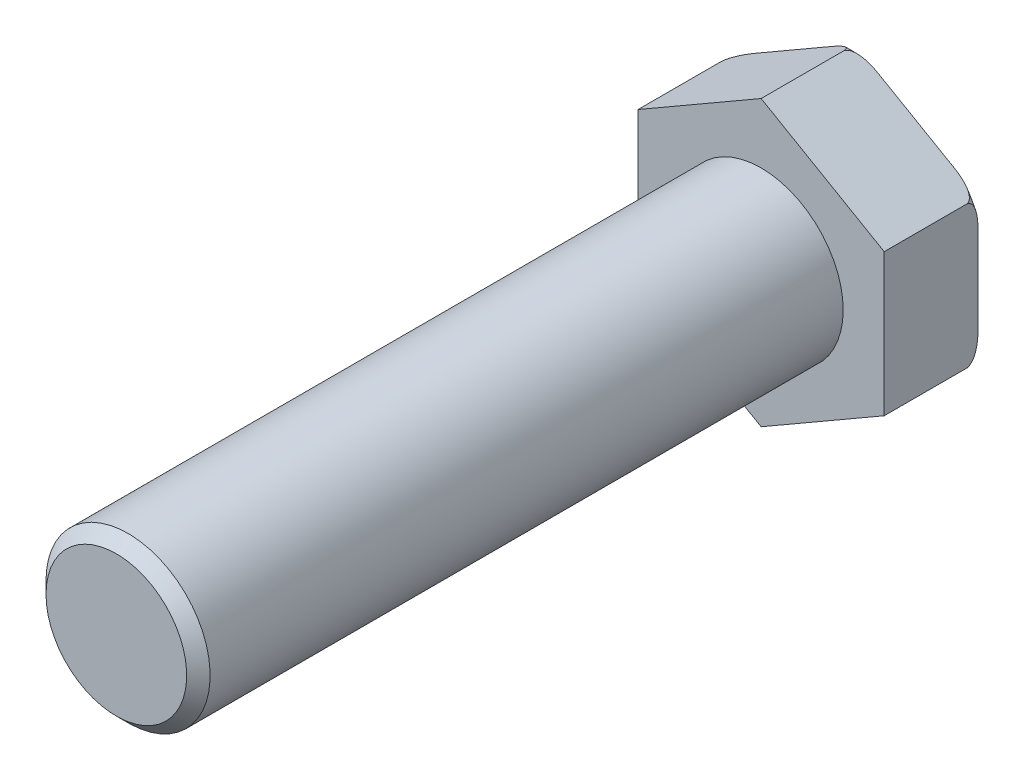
ISO-10303-21;
HEADER;
FILE_DESCRIPTION(('STEP AP214'),'2;1');
FILE_NAME('part.step','',(''),(''),'','','');
FILE_SCHEMA(('AUTOMOTIVE_DESIGN { 1 0 10303 214 1 1 1 1 }'));
ENDSEC;
DATA;
#1=APPLICATION_CONTEXT('core data for automotive mechanical design processes');
#2=APPLICATION_PROTOCOL_DEFINITION('international standard','automotive_design',2000,#1);
#3=PRODUCT_CONTEXT('',#1,'mechanical');
#4=PRODUCT('Part','Part','',(#3));
#5=PRODUCT_RELATED_PRODUCT_CATEGORY('part','',(#4));
#6=PRODUCT_DEFINITION_FORMATION('','',#4);
#7=PRODUCT_DEFINITION_CONTEXT('part definition',#1,'design');
#8=PRODUCT_DEFINITION('design','',#6,#7);
#9=PRODUCT_DEFINITION_SHAPE('','',#8);
#10=(LENGTH_UNIT() NAMED_UNIT(*) SI_UNIT(.MILLI.,.METRE.));
#11=(NAMED_UNIT(*) PLANE_ANGLE_UNIT() SI_UNIT($,.RADIAN.));
#12=(NAMED_UNIT(*) SI_UNIT($,.STERADIAN.) SOLID_ANGLE_UNIT());
#13=UNCERTAINTY_MEASURE_WITH_UNIT(LENGTH_MEASURE(1.E-05),#10,'distance_accuracy_value','');
#14=(GEOMETRIC_REPRESENTATION_CONTEXT(3) GLOBAL_UNCERTAINTY_ASSIGNED_CONTEXT((#13)) GLOBAL_UNIT_ASSIGNED_CONTEXT((#10,
#11,#12)) REPRESENTATION_CONTEXT('',''));
#15=CARTESIAN_POINT('',(0.,0.,0.));
#16=DIRECTION('',(0.,0.,1.));
#17=DIRECTION('',(1.,0.,0.));
#18=AXIS2_PLACEMENT_3D('',#15,#16,#17);
#19=CARTESIAN_POINT('',(0.,12.1243556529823,8.));
#20=DIRECTION('',(0.,0.,1.));
#21=DIRECTION('',(1.,0.,0.));
#22=AXIS2_PLACEMENT_3D('',#19,#20,#21);
#23=PLANE('',#22);
#24=DIRECTION('',(-0.866025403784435,-0.500000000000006,0.));
#25=VECTOR('',#24,1.);
#26=CARTESIAN_POINT('',(-10.5,6.06217782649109,8.));
#27=LINE('',#26,#25);
#28=CARTESIAN_POINT('',(0.,12.1243556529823,8.));
#29=VERTEX_POINT('',#28);
#30=CARTESIAN_POINT('',(-10.5,6.06217782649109,8.));
#31=VERTEX_POINT('',#30);
#32=EDGE_CURVE('E202',#29,#31,#27,.T.);
#33=ORIENTED_EDGE('',*,*,#32,.T.);
#34=DIRECTION('',(0.,-1.,0.));
#35=VECTOR('',#34,1.);
#36=CARTESIAN_POINT('',(-10.5,6.06217782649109,8.));
#37=LINE('',#36,#35);
#38=CARTESIAN_POINT('',(-10.5,-6.06217782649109,8.));
#39=VERTEX_POINT('',#38);
#40=EDGE_CURVE('E204',#31,#39,#37,.T.);
#41=ORIENTED_EDGE('',*,*,#40,.T.);
#42=DIRECTION('',(0.866025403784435,-0.500000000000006,0.));
#43=VECTOR('',#42,1.);
#44=CARTESIAN_POINT('',(-10.5,-6.06217782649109,8.));
#45=LINE('',#44,#43);
#46=CARTESIAN_POINT('',(0.,-12.1243556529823,8.));
#47=VERTEX_POINT('',#46);
#48=EDGE_CURVE('E208',#39,#47,#45,.T.);
#49=ORIENTED_EDGE('',*,*,#48,.T.);
#50=DIRECTION('',(0.866025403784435,0.500000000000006,0.));
#51=VECTOR('',#50,1.);
#52=CARTESIAN_POINT('',(10.5,-6.06217782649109,8.));
#53=LINE('',#52,#51);
#54=CARTESIAN_POINT('',(10.5,-6.06217782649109,8.));
#55=VERTEX_POINT('',#54);
#56=EDGE_CURVE('E216',#47,#55,#53,.T.);
#57=ORIENTED_EDGE('',*,*,#56,.T.);
#58=DIRECTION('',(0.,1.,0.));
#59=VECTOR('',#58,1.);
#60=CARTESIAN_POINT('',(10.5,6.0621778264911,8.));
#61=LINE('',#60,#59);
#62=CARTESIAN_POINT('',(10.5,6.0621778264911,8.));
#63=VERTEX_POINT('',#62);
#64=EDGE_CURVE('E218',#55,#63,#61,.T.);
#65=ORIENTED_EDGE('',*,*,#64,.T.);
#66=DIRECTION('',(-0.866025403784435,0.500000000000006,0.));
#67=VECTOR('',#66,1.);
#68=CARTESIAN_POINT('',(10.5,6.0621778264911,8.));
#69=LINE('',#68,#67);
#70=EDGE_CURVE('E148',#63,#29,#69,.T.);
#71=ORIENTED_EDGE('',*,*,#70,.T.);
#72=EDGE_LOOP('',(#33,#41,#49,#57,#65,#71));
#73=FACE_BOUND('',#72,.T.);
#74=CARTESIAN_POINT('',(0.,0.,8.));
#75=DIRECTION('',(0.,0.,1.));
#76=DIRECTION('',(1.,0.,0.));
#77=AXIS2_PLACEMENT_3D('',#74,#75,#76);
#78=CIRCLE('',#77,7.);
#79=CARTESIAN_POINT('',(7.,0.,8.));
#80=VERTEX_POINT('',#79);
#81=EDGE_CURVE('E402',#80,#80,#78,.T.);
#82=ORIENTED_EDGE('',*,*,#81,.F.);
#83=EDGE_LOOP('',(#82));
#84=FACE_BOUND('',#83,.T.);
#85=ADVANCED_FACE('F32',(#73,#84),#23,.T.);
#86=CARTESIAN_POINT('',(-10.5,6.06217782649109,8.));
#87=DIRECTION('',(0.500000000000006,-0.866025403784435,0.));
#88=DIRECTION('',(0.866025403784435,0.500000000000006,0.));
#89=AXIS2_PLACEMENT_3D('',#86,#87,#88);
#90=PLANE('',#89);
#91=CARTESIAN_POINT('',(-10.4999999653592,6.06217784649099,1.0002));
#92=CARTESIAN_POINT('',(-10.5000735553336,6.06213535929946,0.970115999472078));
#93=CARTESIAN_POINT('',(-10.4976731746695,6.06352121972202,0.940110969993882));
#94=CARTESIAN_POINT('',(-10.4884777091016,6.06883022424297,0.881272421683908));
#95=CARTESIAN_POINT('',(-10.4817214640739,6.07273094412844,0.852430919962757));
#96=CARTESIAN_POINT('',(-10.4643767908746,6.08274489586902,0.796462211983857));
#97=CARTESIAN_POINT('',(-10.4538000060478,6.08885140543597,0.769330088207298));
#98=CARTESIAN_POINT('',(-10.4294977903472,6.10288229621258,0.716973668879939));
#99=CARTESIAN_POINT('',(-10.4157652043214,6.11081080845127,0.691753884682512));
#100=CARTESIAN_POINT('',(-10.3753853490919,6.13412412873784,0.626550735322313));
#101=CARTESIAN_POINT('',(-10.3463996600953,6.15085902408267,0.588501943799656));
#102=CARTESIAN_POINT('',(-10.2837300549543,6.18704133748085,0.517964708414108));
#103=CARTESIAN_POINT('',(-10.2500320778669,6.2064968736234,0.485493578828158));
#104=CARTESIAN_POINT('',(-10.1838174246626,6.24472592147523,0.429063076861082));
#105=CARTESIAN_POINT('',(-10.1516486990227,6.2632985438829,0.404549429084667));
#106=CARTESIAN_POINT('',(-10.0855980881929,6.30143288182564,0.358793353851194));
#107=CARTESIAN_POINT('',(-10.051714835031,6.32099538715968,0.3375535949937));
#108=CARTESIAN_POINT('',(-9.94819609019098,6.38076196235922,0.278064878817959));
#109=CARTESIAN_POINT('',(-9.87672727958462,6.42202449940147,0.244074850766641));
#110=CARTESIAN_POINT('',(-9.72729871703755,6.50829712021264,0.183221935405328));
#111=CARTESIAN_POINT('',(-9.64919723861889,6.55338902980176,0.156846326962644));
#112=CARTESIAN_POINT('',(-9.49130744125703,6.64454674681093,0.11162282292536));
#113=CARTESIAN_POINT('',(-9.41151708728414,6.69061372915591,0.0927846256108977));
#114=CARTESIAN_POINT('',(-9.25078507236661,6.78341240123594,0.0611089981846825));
#115=CARTESIAN_POINT('',(-9.16984032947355,6.83014587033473,0.0482931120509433));
#116=CARTESIAN_POINT('',(-9.0075859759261,6.92382346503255,0.0276267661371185));
#117=CARTESIAN_POINT('',(-8.92627688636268,6.97076728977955,0.0197706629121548));
#118=CARTESIAN_POINT('',(-8.74780790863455,7.07380640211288,0.0069855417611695));
#119=CARTESIAN_POINT('',(-8.65060387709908,7.12992717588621,0.00290883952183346));
#120=CARTESIAN_POINT('',(-8.45612470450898,7.24220977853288,-0.000696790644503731));
#121=CARTESIAN_POINT('',(-8.35884955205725,7.29837161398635,-0.000224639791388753));
#122=CARTESIAN_POINT('',(-8.06695506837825,7.46689697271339,0.00650322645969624));
#123=CARTESIAN_POINT('',(-7.87243913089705,7.57920080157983,0.0180789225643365));
#124=CARTESIAN_POINT('',(-7.48312824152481,7.80396954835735,0.0488678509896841));
#125=CARTESIAN_POINT('',(-7.2883355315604,7.91643317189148,0.0681128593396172));
#126=CARTESIAN_POINT('',(-6.8989621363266,8.141238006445,0.108361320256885));
#127=CARTESIAN_POINT('',(-6.70438140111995,8.25357924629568,0.129364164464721));
#128=CARTESIAN_POINT('',(-6.31499559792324,8.47839124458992,0.16730301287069));
#129=CARTESIAN_POINT('',(-6.12019071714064,8.5908618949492,0.184241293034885));
#130=CARTESIAN_POINT('',(-5.82766785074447,8.75975005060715,0.202792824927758));
#131=CARTESIAN_POINT('',(-5.73011937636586,8.81606968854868,0.207833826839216));
#132=CARTESIAN_POINT('',(-5.53494543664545,8.92875341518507,0.21521944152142));
#133=CARTESIAN_POINT('',(-5.43731997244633,8.98511750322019,0.217564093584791));
#134=CARTESIAN_POINT('',(-5.24224821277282,9.09774223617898,0.219337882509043));
#135=CARTESIAN_POINT('',(-5.14480195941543,9.1540028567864,0.21877297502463));
#136=CARTESIAN_POINT('',(-4.94995339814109,9.26649872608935,0.214794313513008));
#137=CARTESIAN_POINT('',(-4.85255109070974,9.32273397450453,0.211380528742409));
#138=CARTESIAN_POINT('',(-4.6578173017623,9.43516357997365,0.202005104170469));
#139=CARTESIAN_POINT('',(-4.56048584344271,9.49135792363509,0.196042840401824));
#140=CARTESIAN_POINT('',(-4.36593309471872,9.60368300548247,0.182070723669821));
#141=CARTESIAN_POINT('',(-4.26871180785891,9.65981374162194,0.17406080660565));
#142=CARTESIAN_POINT('',(-4.11499201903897,9.74856390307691,0.160266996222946));
#143=CARTESIAN_POINT('',(-4.05846097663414,9.78120211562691,0.154952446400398));
#144=CARTESIAN_POINT('',(-3.9454301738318,9.84646048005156,0.143978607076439));
#145=CARTESIAN_POINT('',(-3.88893041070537,9.87908063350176,0.138319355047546));
#146=CARTESIAN_POINT('',(-3.71941782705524,9.97694876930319,0.121026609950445));
#147=CARTESIAN_POINT('',(-3.60642923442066,10.0421827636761,0.109081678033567));
#148=CARTESIAN_POINT('',(-3.38029113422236,10.1727436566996,0.0854772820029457));
#149=CARTESIAN_POINT('',(-3.26714159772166,10.238070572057,0.0738181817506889));
#150=CARTESIAN_POINT('',(-3.04074529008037,10.3687805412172,0.0519485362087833));
#151=CARTESIAN_POINT('',(-2.92749853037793,10.4341635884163,0.0417378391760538));
#152=CARTESIAN_POINT('',(-2.73827829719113,10.5434099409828,0.0268804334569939));
#153=CARTESIAN_POINT('',(-2.66234889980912,10.5872477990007,0.0215099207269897));
#154=CARTESIAN_POINT('',(-2.51042028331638,10.6749638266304,0.0123232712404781));
#155=CARTESIAN_POINT('',(-2.43442106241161,10.718841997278,0.00850717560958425));
#156=CARTESIAN_POINT('',(-2.20606131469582,10.8506855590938,-4.11061402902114E-05));
#157=CARTESIAN_POINT('',(-2.05358848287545,10.9387157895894,-0.00185113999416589));
#158=CARTESIAN_POINT('',(-1.8149317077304,11.0765043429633,0.004364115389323));
#159=CARTESIAN_POINT('',(-1.72867341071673,11.126305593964,0.00846482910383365));
#160=CARTESIAN_POINT('',(-1.55641878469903,11.2257568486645,0.0212483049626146));
#161=CARTESIAN_POINT('',(-1.47042239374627,11.2754068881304,0.029929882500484));
#162=CARTESIAN_POINT('',(-1.29930085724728,11.3742039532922,0.0529020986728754));
#163=CARTESIAN_POINT('',(-1.21417365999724,11.4233521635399,0.067171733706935));
#164=CARTESIAN_POINT('',(-1.04504615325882,11.5209979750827,0.102691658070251));
#165=CARTESIAN_POINT('',(-0.961044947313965,11.5694960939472,0.123936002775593));
#166=CARTESIAN_POINT('',(-0.820636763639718,11.650560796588,0.167411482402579));
#167=CARTESIAN_POINT('',(-0.763698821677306,11.6834339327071,0.187323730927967));
#168=CARTESIAN_POINT('',(-0.651160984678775,11.7484076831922,0.232361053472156));
#169=CARTESIAN_POINT('',(-0.595566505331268,11.7805051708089,0.257504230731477));
#170=CARTESIAN_POINT('',(-0.47375215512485,11.8508347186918,0.320878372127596));
#171=CARTESIAN_POINT('',(-0.408150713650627,11.8887097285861,0.360799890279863));
#172=CARTESIAN_POINT('',(-0.315154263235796,11.9424012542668,0.430037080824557));
#173=CARTESIAN_POINT('',(-0.285114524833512,11.9597447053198,0.454613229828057));
#174=CARTESIAN_POINT('',(-0.22751225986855,11.9930013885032,0.507339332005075));
#175=CARTESIAN_POINT('',(-0.199945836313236,12.0089168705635,0.535483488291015));
#176=CARTESIAN_POINT('',(-0.152369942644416,12.0363848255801,0.591010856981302));
#177=CARTESIAN_POINT('',(-0.131854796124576,12.0482292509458,0.617810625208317));
#178=CARTESIAN_POINT('',(-0.0941389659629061,12.0700044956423,0.674428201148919));
#179=CARTESIAN_POINT('',(-0.0769394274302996,12.0799346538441,0.704247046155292));
#180=CARTESIAN_POINT('',(-0.0467779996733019,12.0973483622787,0.767179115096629));
#181=CARTESIAN_POINT('',(-0.0338739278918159,12.1047985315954,0.800330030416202));
#182=CARTESIAN_POINT('',(-0.0139192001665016,12.1163193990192,0.868873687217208));
#183=CARTESIAN_POINT('',(-0.00684720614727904,12.1204024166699,0.904257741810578));
#184=CARTESIAN_POINT('',(-0.00207630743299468,12.1231568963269,0.950023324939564));
#185=CARTESIAN_POINT('',(-0.0012957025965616,12.1236075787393,0.960038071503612));
#186=CARTESIAN_POINT('',(-0.000256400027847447,12.1242076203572,0.980100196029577));
#187=CARTESIAN_POINT('',(2.47475785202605E-06,12.1243570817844,0.990147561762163));
#188=CARTESIAN_POINT('',(-3.46409528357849E-08,12.1243556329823,1.00019999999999));
#189=B_SPLINE_CURVE_WITH_KNOTS('',3,(#91,#92,#93,#94,#95,#96,#97,#98,#99,#100,#101,#102,#103,
#104,#105,#106,#107,#108,#109,#110,#111,#112,#113,#114,#115,#116,#117,#118,#119,#120,#121,#122,
#123,#124,#125,#126,#127,#128,#129,#130,#131,#132,#133,#134,#135,#136,#137,#138,#139,#140,#141,
#142,#143,#144,#145,#146,#147,#148,#149,#150,#151,#152,#153,#154,#155,#156,#157,#158,#159,#160,
#161,#162,#163,#164,#165,#166,#167,#168,#169,#170,#171,#172,#173,#174,#175,#176,#177,#178,#179,
#180,#181,#182,#183,#184,#185,#186,#187,#188),.UNSPECIFIED.,.F.,.F.,(4,2,2,2,2,2,2,2,2,2,2,2,2,
2,2,2,2,2,2,2,2,2,2,2,2,2,2,2,2,2,2,2,2,2,2,2,2,2,2,2,2,2,2,2,2,2,2,2,4),(0.,0.0899962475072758,
0.179200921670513,0.268136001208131,0.357274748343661,0.508424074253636,0.660034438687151,
0.793354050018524,0.926781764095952,1.19378566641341,1.47528925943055,1.75715390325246,
2.04001934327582,2.32256234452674,2.65938724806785,2.99629203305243,3.67069813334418,
4.34792802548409,5.02492450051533,5.70154099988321,6.03976798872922,6.37799004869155,
6.71552006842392,7.05305373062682,7.39067008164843,7.72829700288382,7.92477346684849,
8.12122860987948,8.51426930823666,8.90778678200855,9.30126299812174,9.56476943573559,
9.82828284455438,10.3561770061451,10.6551582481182,10.9540622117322,11.2518533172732,
11.5493912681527,11.7552953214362,11.9619241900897,12.2177069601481,12.3450583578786,
12.4722054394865,12.5792463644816,12.6863241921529,12.7947899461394,12.9028570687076,
12.9330097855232,12.9631522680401),.UNSPECIFIED.);
#190=CARTESIAN_POINT('',(-10.5,6.0621778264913,1.));
#191=VERTEX_POINT('',#190);
#192=CARTESIAN_POINT('',(-8.43213238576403,7.25606175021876,0.));
#193=VERTEX_POINT('',#192);
#194=EDGE_CURVE('E179',#191,#193,#189,.T.);
#195=ORIENTED_EDGE('',*,*,#194,.F.);
#196=DIRECTION('',(0.,0.,-1.));
#197=VECTOR('',#196,1.);
#198=CARTESIAN_POINT('',(-10.5,6.06217782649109,8.));
#199=LINE('',#198,#197);
#200=EDGE_CURVE('E163',#31,#191,#199,.T.);
#201=ORIENTED_EDGE('',*,*,#200,.F.);
#202=ORIENTED_EDGE('',*,*,#32,.F.);
#203=DIRECTION('',(0.,0.,-1.));
#204=VECTOR('',#203,1.);
#205=CARTESIAN_POINT('',(0.,12.1243556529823,8.));
#206=LINE('',#205,#204);
#207=CARTESIAN_POINT('',(0.,12.1243556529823,1.));
#208=VERTEX_POINT('',#207);
#209=EDGE_CURVE('E150',#29,#208,#206,.T.);
#210=ORIENTED_EDGE('',*,*,#209,.T.);
#211=CARTESIAN_POINT('',(-2.06786761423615,10.9304717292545,0.));
#212=VERTEX_POINT('',#211);
#213=EDGE_CURVE('E223',#212,#208,#189,.T.);
#214=ORIENTED_EDGE('',*,*,#213,.F.);
#215=DIRECTION('',(-0.866025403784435,-0.500000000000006,0.));
#216=VECTOR('',#215,1.);
#217=CARTESIAN_POINT('',(-10.5,6.06217782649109,0.));
#218=LINE('',#217,#216);
#219=EDGE_CURVE('E191',#212,#193,#218,.T.);
#220=ORIENTED_EDGE('',*,*,#219,.T.);
#221=EDGE_LOOP('',(#195,#201,#202,#210,#214,#220));
#222=FACE_BOUND('',#221,.T.);
#223=ADVANCED_FACE('F34',(#222),#90,.F.);
#224=CARTESIAN_POINT('',(-10.5,6.06217782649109,8.));
#225=DIRECTION('',(1.,0.,0.));
#226=DIRECTION('',(0.,1.,0.));
#227=AXIS2_PLACEMENT_3D('',#224,#225,#226);
#228=PLANE('',#227);
#229=CARTESIAN_POINT('',(-10.5,0.,0.218859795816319));
#230=CARTESIAN_POINT('',(-10.5,0.166665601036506,0.218854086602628));
#231=CARTESIAN_POINT('',(-10.5,0.333334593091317,0.215632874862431));
#232=CARTESIAN_POINT('',(-10.5,0.666487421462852,0.203366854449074));
#233=CARTESIAN_POINT('',(-10.5,0.832971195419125,0.194320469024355));
#234=CARTESIAN_POINT('',(-10.5,1.16629512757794,0.172020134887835));
#235=CARTESIAN_POINT('',(-10.5,1.33313412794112,0.158749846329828));
#236=CARTESIAN_POINT('',(-10.5,1.66664317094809,0.130210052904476));
#237=CARTESIAN_POINT('',(-10.5,1.83331320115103,0.114940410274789));
#238=CARTESIAN_POINT('',(-10.5,2.16651306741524,0.0847718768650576));
#239=CARTESIAN_POINT('',(-10.5,2.33304286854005,0.0698726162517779));
#240=CARTESIAN_POINT('',(-10.5,2.66636705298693,0.0428009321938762));
#241=CARTESIAN_POINT('',(-10.5,2.83316147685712,0.0306289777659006));
#242=CARTESIAN_POINT('',(-10.5,3.16655520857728,0.0115250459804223));
#243=CARTESIAN_POINT('',(-10.5,3.33315352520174,0.00457698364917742));
#244=CARTESIAN_POINT('',(-10.5,3.66647351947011,-0.00138864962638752));
#245=CARTESIAN_POINT('',(-10.5,3.83319509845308,-0.000410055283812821));
#246=CARTESIAN_POINT('',(-10.5,4.13324883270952,0.011594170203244));
#247=CARTESIAN_POINT('',(-10.5,4.26665590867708,0.020592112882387));
#248=CARTESIAN_POINT('',(-10.5,4.53281286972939,0.0482878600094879));
#249=CARTESIAN_POINT('',(-10.5,4.66556113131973,0.0670031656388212));
#250=CARTESIAN_POINT('',(-10.5,4.86339123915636,0.105012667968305));
#251=CARTESIAN_POINT('',(-10.5,4.92941111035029,0.119425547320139));
#252=CARTESIAN_POINT('',(-10.5,5.0604530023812,0.152199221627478));
#253=CARTESIAN_POINT('',(-10.5,5.12547542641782,0.170558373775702));
#254=CARTESIAN_POINT('',(-10.5,5.25404538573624,0.211989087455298));
#255=CARTESIAN_POINT('',(-10.5,5.31759252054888,0.235061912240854));
#256=CARTESIAN_POINT('',(-10.5,5.442285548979,0.286899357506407));
#257=CARTESIAN_POINT('',(-10.5,5.5034341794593,0.315657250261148));
#258=CARTESIAN_POINT('',(-10.5,5.62796803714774,0.38341800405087));
#259=CARTESIAN_POINT('',(-10.5,5.69095951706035,0.423160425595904));
#260=CARTESIAN_POINT('',(-10.5,5.80869150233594,0.513272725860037));
#261=CARTESIAN_POINT('',(-10.5,5.86348946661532,0.563562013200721));
#262=CARTESIAN_POINT('',(-10.5,5.9320451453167,0.645477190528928));
#263=CARTESIAN_POINT('',(-10.5,5.95176707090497,0.672095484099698));
#264=CARTESIAN_POINT('',(-10.5,5.98727087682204,0.727891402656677));
#265=CARTESIAN_POINT('',(-10.5,6.00305277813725,0.757069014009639));
#266=CARTESIAN_POINT('',(-10.5,6.02971299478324,0.817990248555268));
#267=CARTESIAN_POINT('',(-10.5,6.04053918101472,0.849757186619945));
#268=CARTESIAN_POINT('',(-10.5,6.05597097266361,0.914765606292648));
#269=CARTESIAN_POINT('',(-10.5,6.06058497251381,0.948005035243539));
#270=CARTESIAN_POINT('',(-10.5,6.06295433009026,1.01146413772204));
#271=CARTESIAN_POINT('',(-10.5,6.06133591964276,1.04166145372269));
#272=CARTESIAN_POINT('',(-10.5,6.05278540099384,1.10129314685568));
#273=CARTESIAN_POINT('',(-10.5,6.04585111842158,1.13072720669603));
#274=CARTESIAN_POINT('',(-10.5,6.02768936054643,1.18680756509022));
#275=CARTESIAN_POINT('',(-10.5,6.01665956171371,1.21351932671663));
#276=CARTESIAN_POINT('',(-10.5,5.99102554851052,1.26514402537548));
#277=CARTESIAN_POINT('',(-10.5,5.97642043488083,1.29005650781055));
#278=CARTESIAN_POINT('',(-10.5,5.93354064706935,1.35406326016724));
#279=CARTESIAN_POINT('',(-10.5,5.90268008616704,1.39142265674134));
#280=CARTESIAN_POINT('',(-10.5,5.83556157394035,1.46095823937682));
#281=CARTESIAN_POINT('',(-10.5,5.7992862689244,1.49311704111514));
#282=CARTESIAN_POINT('',(-10.5,5.72833361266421,1.54874149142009));
#283=CARTESIAN_POINT('',(-10.5,5.69410843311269,1.5727946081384));
#284=CARTESIAN_POINT('',(-10.5,5.62370501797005,1.61787319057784));
#285=CARTESIAN_POINT('',(-10.5,5.58752528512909,1.63889628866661));
#286=CARTESIAN_POINT('',(-10.5,5.47680696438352,1.69803135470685));
#287=CARTESIAN_POINT('',(-10.5,5.40014630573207,1.73216723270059));
#288=CARTESIAN_POINT('',(-10.5,5.24099532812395,1.79327048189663));
#289=CARTESIAN_POINT('',(-10.5,5.15839452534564,1.81993650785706));
#290=CARTESIAN_POINT('',(-10.5,4.9911982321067,1.8663350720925));
#291=CARTESIAN_POINT('',(-10.5,4.90660045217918,1.88605919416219));
#292=CARTESIAN_POINT('',(-10.5,4.73609389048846,1.91991773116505));
#293=CARTESIAN_POINT('',(-10.5,4.65018225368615,1.93403735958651));
#294=CARTESIAN_POINT('',(-10.5,4.47782671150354,1.95761890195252));
#295=CARTESIAN_POINT('',(-10.5,4.3913834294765,1.96708549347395));
#296=CARTESIAN_POINT('',(-10.5,4.20827671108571,1.98303713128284));
#297=CARTESIAN_POINT('',(-10.5,4.11157391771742,1.98905799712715));
#298=CARTESIAN_POINT('',(-10.5,3.91799732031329,1.99720136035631));
#299=CARTESIAN_POINT('',(-10.5,3.82112348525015,1.99932305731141));
#300=CARTESIAN_POINT('',(-10.5,3.53032735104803,2.00094340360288));
#301=CARTESIAN_POINT('',(-10.5,3.33638450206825,1.99568637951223));
#302=CARTESIAN_POINT('',(-10.5,2.94807447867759,1.97714638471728));
#303=CARTESIAN_POINT('',(-10.5,2.75370944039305,1.96382669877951));
#304=CARTESIAN_POINT('',(-10.5,2.36539391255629,1.93309761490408));
#305=CARTESIAN_POINT('',(-10.5,2.17144329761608,1.91568971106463));
#306=CARTESIAN_POINT('',(-10.5,1.78362435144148,1.88054350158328));
#307=CARTESIAN_POINT('',(-10.5,1.58975601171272,1.86280527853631));
#308=CARTESIAN_POINT('',(-10.5,1.20171998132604,1.83068854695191));
#309=CARTESIAN_POINT('',(-10.5,1.00755229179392,1.81631002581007));
#310=CARTESIAN_POINT('',(-10.5,0.619479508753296,1.79425961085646));
#311=CARTESIAN_POINT('',(-10.5,0.425575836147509,1.78656465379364));
#312=CARTESIAN_POINT('',(-10.5,0.0376196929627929,1.77978463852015));
#313=CARTESIAN_POINT('',(-10.5,-0.156432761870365,1.78069876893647));
#314=CARTESIAN_POINT('',(-10.5,-0.47214303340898,1.78896344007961));
#315=CARTESIAN_POINT('',(-10.5,-0.593876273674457,1.79379297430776));
#316=CARTESIAN_POINT('',(-10.5,-0.837202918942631,1.8062023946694));
#317=CARTESIAN_POINT('',(-10.5,-0.958796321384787,1.81378233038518));
#318=CARTESIAN_POINT('',(-10.5,-1.32373475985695,1.83962713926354));
#319=CARTESIAN_POINT('',(-10.5,-1.56684928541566,1.86098265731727));
#320=CARTESIAN_POINT('',(-10.5,-2.05414413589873,1.90497950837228));
#321=CARTESIAN_POINT('',(-10.5,-2.29832377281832,1.92762668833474));
#322=CARTESIAN_POINT('',(-10.5,-2.78705995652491,1.96661915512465));
#323=CARTESIAN_POINT('',(-10.5,-3.03161595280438,1.98297019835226));
#324=CARTESIAN_POINT('',(-10.5,-3.399524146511,1.99676864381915));
#325=CARTESIAN_POINT('',(-10.5,-3.52265671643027,1.99957339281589));
#326=CARTESIAN_POINT('',(-10.5,-3.76892678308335,2.00033787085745));
#327=CARTESIAN_POINT('',(-10.5,-3.89206427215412,1.99829871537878));
#328=CARTESIAN_POINT('',(-10.5,-4.13750387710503,1.98796078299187));
#329=CARTESIAN_POINT('',(-10.5,-4.25980716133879,1.97969217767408));
#330=CARTESIAN_POINT('',(-10.5,-4.50357322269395,1.95512569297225));
#331=CARTESIAN_POINT('',(-10.5,-4.62503660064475,1.93883432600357));
#332=CARTESIAN_POINT('',(-10.5,-4.82520618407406,1.90303417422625));
#333=CARTESIAN_POINT('',(-10.5,-4.90443917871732,1.8864916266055));
#334=CARTESIAN_POINT('',(-10.5,-5.06195360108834,1.84770948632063));
#335=CARTESIAN_POINT('',(-10.5,-5.14022854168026,1.82544262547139));
#336=CARTESIAN_POINT('',(-10.5,-5.27022434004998,1.78200498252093));
#337=CARTESIAN_POINT('',(-10.5,-5.32256202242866,1.76268748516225));
#338=CARTESIAN_POINT('',(-10.5,-5.4257093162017,1.72015668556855));
#339=CARTESIAN_POINT('',(-10.5,-5.47651758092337,1.69694006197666));
#340=CARTESIAN_POINT('',(-10.5,-5.57544015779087,1.64609068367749));
#341=CARTESIAN_POINT('',(-10.5,-5.62357129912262,1.61849109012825));
#342=CARTESIAN_POINT('',(-10.5,-5.71627767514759,1.55792544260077));
#343=CARTESIAN_POINT('',(-10.5,-5.76086094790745,1.52497206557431));
#344=CARTESIAN_POINT('',(-10.5,-5.83050926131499,1.4648465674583));
#345=CARTESIAN_POINT('',(-10.5,-5.85709971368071,1.43945137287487));
#346=CARTESIAN_POINT('',(-10.5,-5.90702962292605,1.38556337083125));
#347=CARTESIAN_POINT('',(-10.5,-5.93036704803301,1.35706864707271));
#348=CARTESIAN_POINT('',(-10.5,-5.97282262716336,1.29656072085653));
#349=CARTESIAN_POINT('',(-10.5,-5.99189132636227,1.26451212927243));
#350=CARTESIAN_POINT('',(-10.5,-6.0239139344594,1.19748818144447));
#351=CARTESIAN_POINT('',(-10.5,-6.03688126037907,1.16251944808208));
#352=CARTESIAN_POINT('',(-10.5,-6.05316081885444,1.09887775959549));
#353=CARTESIAN_POINT('',(-10.5,-6.05800380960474,1.0705962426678));
#354=CARTESIAN_POINT('',(-10.5,-6.06280347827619,1.01362256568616));
#355=CARTESIAN_POINT('',(-10.5,-6.0627626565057,0.984930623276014));
#356=CARTESIAN_POINT('',(-10.5,-6.05780124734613,0.928011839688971));
#357=CARTESIAN_POINT('',(-10.5,-6.05288587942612,0.899784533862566));
#358=CARTESIAN_POINT('',(-10.5,-6.03860253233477,0.844484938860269));
#359=CARTESIAN_POINT('',(-10.5,-6.02923127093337,0.817413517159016));
#360=CARTESIAN_POINT('',(-10.5,-6.00283809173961,0.755957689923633));
#361=CARTESIAN_POINT('',(-10.5,-5.98429688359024,0.722228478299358));
#362=CARTESIAN_POINT('',(-10.5,-5.94205554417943,0.658182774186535));
#363=CARTESIAN_POINT('',(-10.5,-5.91834447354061,0.627873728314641));
#364=CARTESIAN_POINT('',(-10.5,-5.85295401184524,0.554701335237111));
#365=CARTESIAN_POINT('',(-10.5,-5.80861654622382,0.51423336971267));
#366=CARTESIAN_POINT('',(-10.5,-5.71446210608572,0.440348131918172));
#367=CARTESIAN_POINT('',(-10.5,-5.66463224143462,0.406948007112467));
#368=CARTESIAN_POINT('',(-10.5,-5.56483084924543,0.347958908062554));
#369=CARTESIAN_POINT('',(-10.5,-5.51506890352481,0.322008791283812));
#370=CARTESIAN_POINT('',(-10.5,-5.4135035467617,0.274413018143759));
#371=CARTESIAN_POINT('',(-10.5,-5.36169832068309,0.252771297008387));
#372=CARTESIAN_POINT('',(-10.5,-5.25663234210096,0.21311607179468));
#373=CARTESIAN_POINT('',(-10.5,-5.20336922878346,0.195108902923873));
#374=CARTESIAN_POINT('',(-10.5,-5.09591427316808,0.162246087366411));
#375=CARTESIAN_POINT('',(-10.5,-5.04172279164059,0.147389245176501));
#376=CARTESIAN_POINT('',(-10.5,-4.90851643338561,0.114404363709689));
#377=CARTESIAN_POINT('',(-10.5,-4.82913952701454,0.0977427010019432));
#378=CARTESIAN_POINT('',(-10.5,-4.66953806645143,0.0690545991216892));
#379=CARTESIAN_POINT('',(-10.5,-4.58931311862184,0.0570304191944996));
#380=CARTESIAN_POINT('',(-10.5,-4.42824887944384,0.0368396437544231));
#381=CARTESIAN_POINT('',(-10.5,-4.34740877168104,0.0286796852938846));
#382=CARTESIAN_POINT('',(-10.5,-4.18545963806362,0.015630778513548));
#383=CARTESIAN_POINT('',(-10.5,-4.10435056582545,0.0107424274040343));
#384=CARTESIAN_POINT('',(-10.5,-3.86007275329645,0.000167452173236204));
#385=CARTESIAN_POINT('',(-10.5,-3.69672437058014,-0.00134312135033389));
#386=CARTESIAN_POINT('',(-10.5,-3.37013401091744,0.00343885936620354));
#387=CARTESIAN_POINT('',(-10.5,-3.2068921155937,0.00973494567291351));
#388=CARTESIAN_POINT('',(-10.5,-2.78917416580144,0.0324920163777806));
#389=CARTESIAN_POINT('',(-10.5,-2.53491983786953,0.0526749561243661));
#390=CARTESIAN_POINT('',(-10.5,-2.02663881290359,0.0969403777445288));
#391=CARTESIAN_POINT('',(-10.5,-1.77261238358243,0.121025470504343));
#392=CARTESIAN_POINT('',(-10.5,-1.39207468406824,0.153757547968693));
#393=CARTESIAN_POINT('',(-10.5,-1.26571875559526,0.164074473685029));
#394=CARTESIAN_POINT('',(-10.5,-1.01285783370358,0.182641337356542));
#395=CARTESIAN_POINT('',(-10.5,-0.886352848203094,0.19089138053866));
#396=CARTESIAN_POINT('',(-10.5,-0.633255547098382,0.204478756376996));
#397=CARTESIAN_POINT('',(-10.5,-0.506663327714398,0.20981781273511));
#398=CARTESIAN_POINT('',(-10.5,-0.253381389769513,0.217010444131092));
#399=CARTESIAN_POINT('',(-10.5,-0.126691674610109,0.218864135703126));
#400=CARTESIAN_POINT('',(-10.5,0.,0.218859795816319));
#401=B_SPLINE_CURVE_WITH_KNOTS('',3,(#229,#230,#231,#232,#233,#234,#235,#236,#237,#238,#239,
#240,#241,#242,#243,#244,#245,#246,#247,#248,#249,#250,#251,#252,#253,#254,#255,#256,#257,#258,
#259,#260,#261,#262,#263,#264,#265,#266,#267,#268,#269,#270,#271,#272,#273,#274,#275,#276,#277,
#278,#279,#280,#281,#282,#283,#284,#285,#286,#287,#288,#289,#290,#291,#292,#293,#294,#295,#296,
#297,#298,#299,#300,#301,#302,#303,#304,#305,#306,#307,#308,#309,#310,#311,#312,#313,#314,#315,
#316,#317,#318,#319,#320,#321,#322,#323,#324,#325,#326,#327,#328,#329,#330,#331,#332,#333,#334,
#335,#336,#337,#338,#339,#340,#341,#342,#343,#344,#345,#346,#347,#348,#349,#350,#351,#352,#353,
#354,#355,#356,#357,#358,#359,#360,#361,#362,#363,#364,#365,#366,#367,#368,#369,#370,#371,#372,
#373,#374,#375,#376,#377,#378,#379,#380,#381,#382,#383,#384,#385,#386,#387,#388,#389,#390,#391,
#392,#393,#394,#395,#396,#397,#398,#399,#400),.UNSPECIFIED.,.T.,.F.,(4,2,2,2,2,2,2,2,2,2,2,2,2,
2,2,2,2,2,2,2,2,2,2,2,2,2,2,2,2,2,2,2,2,2,2,2,2,2,2,2,2,2,2,2,2,2,2,2,2,2,2,2,2,2,2,2,2,2,2,2,2,
2,2,2,2,2,2,2,2,2,2,2,2,2,2,2,2,2,2,2,2,2,2,2,2,4),(0.,0.499976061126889,1.00008751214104,
1.5021576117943,2.00426232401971,2.50584371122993,3.00751128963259,3.5076277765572,
4.00750233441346,4.40840123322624,4.81002467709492,5.01265440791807,5.21519994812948,
5.41779984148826,5.62016139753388,5.84287857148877,6.06395216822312,6.16307448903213,
6.26219628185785,6.36233804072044,6.46234434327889,6.55257693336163,6.64284645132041,
6.72922980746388,6.81563491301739,6.96017113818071,7.10518094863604,7.23049495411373,
7.35590635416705,7.60693921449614,7.86698418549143,8.12734335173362,8.38838493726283,
8.64916356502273,8.93973467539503,9.23036542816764,9.81208928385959,10.3964822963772,
10.9806620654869,11.5646976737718,12.1487310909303,12.7307410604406,13.3126961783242,
13.6781508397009,14.0436120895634,14.7757007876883,15.5114170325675,16.2464590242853,
16.6158815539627,16.9852190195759,17.35277905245,17.720041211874,17.962716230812,
18.2065693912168,18.3738142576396,18.5412023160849,18.7073794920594,18.8731687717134,
18.9832617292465,19.0934231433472,19.2048014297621,19.3159336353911,19.4016237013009,
19.4872698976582,19.572824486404,19.6584421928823,19.7732634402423,19.8883300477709,
20.0674060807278,20.2469117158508,20.4150281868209,20.5832975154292,20.7518576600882,
20.9203537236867,21.1634914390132,21.4067474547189,21.6504197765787,21.8941365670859,
22.3838918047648,22.8738687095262,23.6388741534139,24.4043935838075,24.7847103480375,
25.1650077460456,25.5450797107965,25.925138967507),.UNSPECIFIED.);
#402=CARTESIAN_POINT('',(-10.5,3.67440997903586,0.));
#403=VERTEX_POINT('',#402);
#404=EDGE_CURVE('E177',#403,#191,#401,.T.);
#405=ORIENTED_EDGE('',*,*,#404,.F.);
#406=DIRECTION('',(0.,-1.,0.));
#407=VECTOR('',#406,1.);
#408=CARTESIAN_POINT('',(-10.5,6.06217782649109,0.));
#409=LINE('',#408,#407);
#410=CARTESIAN_POINT('',(-10.5,-3.67440997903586,0.));
#411=VERTEX_POINT('',#410);
#412=EDGE_CURVE('E186',#403,#411,#409,.T.);
#413=ORIENTED_EDGE('',*,*,#412,.T.);
#414=CARTESIAN_POINT('',(-10.5000000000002,-6.06217782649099,1.));
#415=VERTEX_POINT('',#414);
#416=EDGE_CURVE('E49',#415,#411,#401,.T.);
#417=ORIENTED_EDGE('',*,*,#416,.F.);
#418=DIRECTION('',(0.,0.,-1.));
#419=VECTOR('',#418,1.);
#420=CARTESIAN_POINT('',(-10.5,-6.06217782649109,8.));
#421=LINE('',#420,#419);
#422=EDGE_CURVE('E161',#39,#415,#421,.T.);
#423=ORIENTED_EDGE('',*,*,#422,.F.);
#424=ORIENTED_EDGE('',*,*,#40,.F.);
#425=ORIENTED_EDGE('',*,*,#200,.T.);
#426=EDGE_LOOP('',(#405,#413,#417,#423,#424,#425));
#427=FACE_BOUND('',#426,.T.);
#428=ADVANCED_FACE('F185',(#427),#228,.F.);
#429=CARTESIAN_POINT('',(-10.5,-6.06217782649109,8.));
#430=DIRECTION('',(0.500000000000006,0.866025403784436,0.));
#431=DIRECTION('',(-0.866025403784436,0.500000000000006,0.));
#432=AXIS2_PLACEMENT_3D('',#429,#430,#431);
#433=PLANE('',#432);
#434=CARTESIAN_POINT('',(-3.46410060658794E-08,-12.1243556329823,1.0002));
#435=CARTESIAN_POINT('',(7.35553333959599E-05,-12.1243981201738,0.970115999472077));
#436=CARTESIAN_POINT('',(-0.0023268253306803,-12.1230122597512,0.940110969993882));
#437=CARTESIAN_POINT('',(-0.0115222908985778,-12.1177032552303,0.881272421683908));
#438=CARTESIAN_POINT('',(-0.0182785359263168,-12.1138025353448,0.852430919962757));
#439=CARTESIAN_POINT('',(-0.0356232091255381,-12.1037885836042,0.796462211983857));
#440=CARTESIAN_POINT('',(-0.0461999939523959,-12.0976820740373,0.769330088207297));
#441=CARTESIAN_POINT('',(-0.0705022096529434,-12.0836511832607,0.716973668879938));
#442=CARTESIAN_POINT('',(-0.0842347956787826,-12.075722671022,0.691753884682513));
#443=CARTESIAN_POINT('',(-0.124614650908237,-12.0524093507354,0.626550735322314));
#444=CARTESIAN_POINT('',(-0.153600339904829,-12.0356744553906,0.588501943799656));
#445=CARTESIAN_POINT('',(-0.216269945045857,-11.9994921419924,0.517964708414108));
#446=CARTESIAN_POINT('',(-0.249967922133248,-11.9800366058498,0.485493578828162));
#447=CARTESIAN_POINT('',(-0.316182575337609,-11.941807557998,0.429063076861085));
#448=CARTESIAN_POINT('',(-0.348351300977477,-11.9232349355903,0.404549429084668));
#449=CARTESIAN_POINT('',(-0.414401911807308,-11.8851005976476,0.358793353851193));
#450=CARTESIAN_POINT('',(-0.44828516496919,-11.8655380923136,0.3375535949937));
#451=CARTESIAN_POINT('',(-0.551803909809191,-11.805771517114,0.278064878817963));
#452=CARTESIAN_POINT('',(-0.623272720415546,-11.7645089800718,0.244074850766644));
#453=CARTESIAN_POINT('',(-0.772701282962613,-11.6782363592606,0.183221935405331));
#454=CARTESIAN_POINT('',(-0.850802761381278,-11.6331444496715,0.156846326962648));
#455=CARTESIAN_POINT('',(-1.00869255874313,-11.5419867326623,0.111622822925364));
#456=CARTESIAN_POINT('',(-1.08848291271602,-11.4959197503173,0.0927846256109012));
#457=CARTESIAN_POINT('',(-1.24921492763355,-11.4031210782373,0.0611089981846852));
#458=CARTESIAN_POINT('',(-1.3301596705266,-11.3563876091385,0.0482931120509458));
#459=CARTESIAN_POINT('',(-1.49241402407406,-11.2627100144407,0.0276267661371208));
#460=CARTESIAN_POINT('',(-1.57372311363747,-11.2157661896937,0.0197706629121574));
#461=CARTESIAN_POINT('',(-1.75219209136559,-11.1127270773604,0.00698554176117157));
#462=CARTESIAN_POINT('',(-1.84939612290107,-11.0566063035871,0.00290883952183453));
#463=CARTESIAN_POINT('',(-2.04387529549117,-10.9443237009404,-0.000696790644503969));
#464=CARTESIAN_POINT('',(-2.1411504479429,-10.8881618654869,-0.000224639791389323));
#465=CARTESIAN_POINT('',(-2.43304493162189,-10.7196365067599,0.00650322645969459));
#466=CARTESIAN_POINT('',(-2.62756086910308,-10.6073326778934,0.018078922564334));
#467=CARTESIAN_POINT('',(-3.01687175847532,-10.3825639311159,0.0488678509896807));
#468=CARTESIAN_POINT('',(-3.21166446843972,-10.2701003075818,0.0681128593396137));
#469=CARTESIAN_POINT('',(-3.60103786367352,-10.0452954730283,0.10836132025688));
#470=CARTESIAN_POINT('',(-3.79561859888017,-9.9329542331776,0.129364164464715));
#471=CARTESIAN_POINT('',(-4.18500440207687,-9.70814223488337,0.167303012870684));
#472=CARTESIAN_POINT('',(-4.37980928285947,-9.59567158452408,0.184241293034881));
#473=CARTESIAN_POINT('',(-4.67233214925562,-9.42678342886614,0.202792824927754));
#474=CARTESIAN_POINT('',(-4.76988062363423,-9.37046379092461,0.207833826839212));
#475=CARTESIAN_POINT('',(-4.96505456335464,-9.25778006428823,0.215219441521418));
#476=CARTESIAN_POINT('',(-5.06268002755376,-9.20141597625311,0.217564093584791));
#477=CARTESIAN_POINT('',(-5.25775178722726,-9.08879124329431,0.219337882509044));
#478=CARTESIAN_POINT('',(-5.35519804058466,-9.0325306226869,0.21877297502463));
#479=CARTESIAN_POINT('',(-5.55004660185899,-8.92003475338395,0.21479431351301));
#480=CARTESIAN_POINT('',(-5.64744890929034,-8.86379950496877,0.211380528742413));
#481=CARTESIAN_POINT('',(-5.84218269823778,-8.75136989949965,0.202005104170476));
#482=CARTESIAN_POINT('',(-5.93951415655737,-8.69517555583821,0.196042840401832));
#483=CARTESIAN_POINT('',(-6.13406690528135,-8.58285047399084,0.182070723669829));
#484=CARTESIAN_POINT('',(-6.23128819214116,-8.52671973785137,0.174060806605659));
#485=CARTESIAN_POINT('',(-6.3850079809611,-8.4379695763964,0.160266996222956));
#486=CARTESIAN_POINT('',(-6.44153902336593,-8.4053313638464,0.154952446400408));
#487=CARTESIAN_POINT('',(-6.55456982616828,-8.34007299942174,0.14397860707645));
#488=CARTESIAN_POINT('',(-6.61106958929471,-8.30745284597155,0.138319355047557));
#489=CARTESIAN_POINT('',(-6.78058217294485,-8.20958471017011,0.121026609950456));
#490=CARTESIAN_POINT('',(-6.89357076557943,-8.14435071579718,0.109081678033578));
#491=CARTESIAN_POINT('',(-7.11970886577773,-8.01378982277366,0.0854772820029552));
#492=CARTESIAN_POINT('',(-7.23285840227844,-7.94846290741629,0.0738181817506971));
#493=CARTESIAN_POINT('',(-7.45925470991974,-7.81775293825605,0.0519485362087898));
#494=CARTESIAN_POINT('',(-7.57250146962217,-7.75236989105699,0.0417378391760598));
#495=CARTESIAN_POINT('',(-7.76172170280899,-7.64312353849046,0.0268804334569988));
#496=CARTESIAN_POINT('',(-7.83765110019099,-7.59928568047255,0.021509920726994));
#497=CARTESIAN_POINT('',(-7.98957971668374,-7.51156965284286,0.0123232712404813));
#498=CARTESIAN_POINT('',(-8.06557893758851,-7.46769148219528,0.00850717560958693));
#499=CARTESIAN_POINT('',(-8.2939386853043,-7.33584792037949,-4.11061402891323E-05));
#500=CARTESIAN_POINT('',(-8.44641151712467,-7.2478176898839,-0.00185113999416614));
#501=CARTESIAN_POINT('',(-8.68506829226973,-7.11002913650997,0.00436411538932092));
#502=CARTESIAN_POINT('',(-8.7713265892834,-7.06022788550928,0.00846482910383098));
#503=CARTESIAN_POINT('',(-8.94358121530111,-6.9607766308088,0.0212483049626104));
#504=CARTESIAN_POINT('',(-9.02957760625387,-6.91112659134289,0.0299298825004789));
#505=CARTESIAN_POINT('',(-9.20069914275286,-6.81232952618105,0.0529020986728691));
#506=CARTESIAN_POINT('',(-9.2858263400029,-6.76318131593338,0.0671717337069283));
#507=CARTESIAN_POINT('',(-9.45495384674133,-6.66553550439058,0.102691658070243));
#508=CARTESIAN_POINT('',(-9.53895505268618,-6.61703738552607,0.123936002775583));
#509=CARTESIAN_POINT('',(-9.67936323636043,-6.53597268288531,0.167411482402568));
#510=CARTESIAN_POINT('',(-9.73630117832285,-6.50309954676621,0.187323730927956));
#511=CARTESIAN_POINT('',(-9.84883901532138,-6.43812579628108,0.232361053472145));
#512=CARTESIAN_POINT('',(-9.90443349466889,-6.40602830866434,0.257504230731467));
#513=CARTESIAN_POINT('',(-10.0262478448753,-6.3356987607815,0.320878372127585));
#514=CARTESIAN_POINT('',(-10.0918492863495,-6.29782375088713,0.360799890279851));
#515=CARTESIAN_POINT('',(-10.1848457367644,-6.24413222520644,0.430037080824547));
#516=CARTESIAN_POINT('',(-10.2148854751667,-6.2267887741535,0.454613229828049));
#517=CARTESIAN_POINT('',(-10.2724877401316,-6.19353209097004,0.507339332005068));
#518=CARTESIAN_POINT('',(-10.3000541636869,-6.17761660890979,0.535483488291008));
#519=CARTESIAN_POINT('',(-10.3476300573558,-6.15014865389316,0.591010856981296));
#520=CARTESIAN_POINT('',(-10.3681452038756,-6.13830422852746,0.61781062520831));
#521=CARTESIAN_POINT('',(-10.4058610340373,-6.11652898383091,0.674428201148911));
#522=CARTESIAN_POINT('',(-10.4230605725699,-6.10659882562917,0.704247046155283));
#523=CARTESIAN_POINT('',(-10.4532220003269,-6.08918511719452,0.767179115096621));
#524=CARTESIAN_POINT('',(-10.4661260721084,-6.08173494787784,0.800330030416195));
#525=CARTESIAN_POINT('',(-10.4860807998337,-6.07021408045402,0.868873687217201));
#526=CARTESIAN_POINT('',(-10.4931527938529,-6.06613106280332,0.90425774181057));
#527=CARTESIAN_POINT('',(-10.4979236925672,-6.06337658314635,0.950023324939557));
#528=CARTESIAN_POINT('',(-10.4987042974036,-6.06292590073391,0.960038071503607));
#529=CARTESIAN_POINT('',(-10.4997435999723,-6.06232585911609,0.980100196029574));
#530=CARTESIAN_POINT('',(-10.500002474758,-6.06217639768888,0.990147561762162));
#531=CARTESIAN_POINT('',(-10.4999999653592,-6.06217784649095,1.00019999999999));
#532=B_SPLINE_CURVE_WITH_KNOTS('',3,(#434,#435,#436,#437,#438,#439,#440,#441,#442,#443,#444,
#445,#446,#447,#448,#449,#450,#451,#452,#453,#454,#455,#456,#457,#458,#459,#460,#461,#462,#463,
#464,#465,#466,#467,#468,#469,#470,#471,#472,#473,#474,#475,#476,#477,#478,#479,#480,#481,#482,
#483,#484,#485,#486,#487,#488,#489,#490,#491,#492,#493,#494,#495,#496,#497,#498,#499,#500,#501,
#502,#503,#504,#505,#506,#507,#508,#509,#510,#511,#512,#513,#514,#515,#516,#517,#518,#519,#520,
#521,#522,#523,#524,#525,#526,#527,#528,#529,#530,#531),.UNSPECIFIED.,.F.,.F.,(4,2,2,2,2,2,2,2,
2,2,2,2,2,2,2,2,2,2,2,2,2,2,2,2,2,2,2,2,2,2,2,2,2,2,2,2,2,2,2,2,2,2,2,2,2,2,2,2,4),(0.,
0.0899962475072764,0.179200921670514,0.268136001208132,0.357274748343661,0.508424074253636,
0.660034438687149,0.793354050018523,0.926781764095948,1.1937856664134,1.47528925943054,
1.75715390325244,2.04001934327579,2.32256234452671,2.65938724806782,2.99629203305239,
3.67069813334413,4.34792802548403,5.02492450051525,5.70154099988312,6.03976798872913,
6.37799004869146,6.71552006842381,7.05305373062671,7.39067008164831,7.7282970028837,
7.92477346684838,8.12122860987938,8.51426930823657,8.90778678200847,9.30126299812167,
9.56476943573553,9.82828284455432,10.356177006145,10.6551582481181,10.9540622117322,
11.2518533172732,11.5493912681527,11.7552953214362,11.9619241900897,12.2177069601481,
12.3450583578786,12.4722054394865,12.5792463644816,12.6863241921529,12.7947899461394,
12.9028570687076,12.9330097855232,12.9631522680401),.UNSPECIFIED.);
#533=CARTESIAN_POINT('',(0.,-12.1243556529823,1.));
#534=VERTEX_POINT('',#533);
#535=CARTESIAN_POINT('',(-2.06786761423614,-10.9304717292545,0.));
#536=VERTEX_POINT('',#535);
#537=EDGE_CURVE('E57',#534,#536,#532,.T.);
#538=ORIENTED_EDGE('',*,*,#537,.F.);
#539=DIRECTION('',(0.,0.,-1.));
#540=VECTOR('',#539,1.);
#541=CARTESIAN_POINT('',(0.,-12.1243556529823,8.));
#542=LINE('',#541,#540);
#543=EDGE_CURVE('E153',#47,#534,#542,.T.);
#544=ORIENTED_EDGE('',*,*,#543,.F.);
#545=ORIENTED_EDGE('',*,*,#48,.F.);
#546=ORIENTED_EDGE('',*,*,#422,.T.);
#547=CARTESIAN_POINT('',(-8.43213238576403,-7.25606175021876,0.));
#548=VERTEX_POINT('',#547);
#549=EDGE_CURVE('E263',#548,#415,#532,.T.);
#550=ORIENTED_EDGE('',*,*,#549,.F.);
#551=DIRECTION('',(0.866025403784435,-0.500000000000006,0.));
#552=VECTOR('',#551,1.);
#553=CARTESIAN_POINT('',(-10.5,-6.06217782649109,0.));
#554=LINE('',#553,#552);
#555=EDGE_CURVE('E190',#548,#536,#554,.T.);
#556=ORIENTED_EDGE('',*,*,#555,.T.);
#557=EDGE_LOOP('',(#538,#544,#545,#546,#550,#556));
#558=FACE_BOUND('',#557,.T.);
#559=ADVANCED_FACE('F265',(#558),#433,.F.);
#560=CARTESIAN_POINT('',(10.5,-6.06217782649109,8.));
#561=DIRECTION('',(-0.500000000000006,0.866025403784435,0.));
#562=DIRECTION('',(-0.866025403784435,-0.500000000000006,0.));
#563=AXIS2_PLACEMENT_3D('',#560,#561,#562);
#564=PLANE('',#563);
#565=CARTESIAN_POINT('',(10.4999999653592,-6.06217784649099,1.0002));
#566=CARTESIAN_POINT('',(10.5000735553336,-6.06213535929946,0.970115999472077));
#567=CARTESIAN_POINT('',(10.4976731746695,-6.06352121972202,0.940110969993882));
#568=CARTESIAN_POINT('',(10.4884777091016,-6.06883022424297,0.881272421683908));
#569=CARTESIAN_POINT('',(10.4817214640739,-6.07273094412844,0.852430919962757));
#570=CARTESIAN_POINT('',(10.4643767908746,-6.08274489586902,0.796462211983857));
#571=CARTESIAN_POINT('',(10.4538000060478,-6.08885140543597,0.769330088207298));
#572=CARTESIAN_POINT('',(10.4294977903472,-6.10288229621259,0.716973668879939));
#573=CARTESIAN_POINT('',(10.4157652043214,-6.11081080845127,0.691753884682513));
#574=CARTESIAN_POINT('',(10.3753853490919,-6.13412412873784,0.626550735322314));
#575=CARTESIAN_POINT('',(10.3463996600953,-6.15085902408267,0.588501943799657));
#576=CARTESIAN_POINT('',(10.2837300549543,-6.18704133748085,0.517964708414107));
#577=CARTESIAN_POINT('',(10.2500320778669,-6.2064968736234,0.485493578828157));
#578=CARTESIAN_POINT('',(10.1838174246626,-6.24472592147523,0.42906307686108));
#579=CARTESIAN_POINT('',(10.1516486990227,-6.2632985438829,0.404549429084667));
#580=CARTESIAN_POINT('',(10.0855980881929,-6.30143288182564,0.358793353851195));
#581=CARTESIAN_POINT('',(10.051714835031,-6.32099538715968,0.337553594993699));
#582=CARTESIAN_POINT('',(9.94819609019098,-6.38076196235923,0.278064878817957));
#583=CARTESIAN_POINT('',(9.87672727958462,-6.42202449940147,0.24407485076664));
#584=CARTESIAN_POINT('',(9.72729871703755,-6.50829712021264,0.183221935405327));
#585=CARTESIAN_POINT('',(9.64919723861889,-6.55338902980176,0.156846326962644));
#586=CARTESIAN_POINT('',(9.49130744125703,-6.64454674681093,0.11162282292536));
#587=CARTESIAN_POINT('',(9.41151708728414,-6.69061372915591,0.0927846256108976));
#588=CARTESIAN_POINT('',(9.25078507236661,-6.78341240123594,0.0611089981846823));
#589=CARTESIAN_POINT('',(9.16984032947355,-6.83014587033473,0.0482931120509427));
#590=CARTESIAN_POINT('',(9.0075859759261,-6.92382346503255,0.0276267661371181));
#591=CARTESIAN_POINT('',(8.92627688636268,-6.97076728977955,0.0197706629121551));
#592=CARTESIAN_POINT('',(8.74780790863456,-7.07380640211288,0.0069855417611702));
#593=CARTESIAN_POINT('',(8.65060387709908,-7.1299271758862,0.00290883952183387));
#594=CARTESIAN_POINT('',(8.45612470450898,-7.24220977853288,-0.000696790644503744));
#595=CARTESIAN_POINT('',(8.35884955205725,-7.29837161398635,-0.000224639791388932));
#596=CARTESIAN_POINT('',(8.06695506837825,-7.46689697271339,0.00650322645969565));
#597=CARTESIAN_POINT('',(7.87243913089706,-7.57920080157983,0.0180789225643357));
#598=CARTESIAN_POINT('',(7.48312824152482,-7.80396954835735,0.0488678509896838));
#599=CARTESIAN_POINT('',(7.28833553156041,-7.91643317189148,0.0681128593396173));
#600=CARTESIAN_POINT('',(6.89896213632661,-8.14123800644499,0.108361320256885));
#601=CARTESIAN_POINT('',(6.70438140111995,-8.25357924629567,0.12936416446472));
#602=CARTESIAN_POINT('',(6.31499559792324,-8.47839124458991,0.167303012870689));
#603=CARTESIAN_POINT('',(6.12019071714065,-8.5908618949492,0.184241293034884));
#604=CARTESIAN_POINT('',(5.82766785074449,-8.75975005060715,0.202792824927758));
#605=CARTESIAN_POINT('',(5.73011937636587,-8.81606968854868,0.207833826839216));
#606=CARTESIAN_POINT('',(5.53494543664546,-8.92875341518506,0.215219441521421));
#607=CARTESIAN_POINT('',(5.43731997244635,-8.98511750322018,0.217564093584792));
#608=CARTESIAN_POINT('',(5.24224821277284,-9.09774223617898,0.219337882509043));
#609=CARTESIAN_POINT('',(5.14480195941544,-9.15400285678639,0.21877297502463));
#610=CARTESIAN_POINT('',(4.94995339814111,-9.26649872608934,0.214794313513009));
#611=CARTESIAN_POINT('',(4.85255109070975,-9.32273397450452,0.211380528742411));
#612=CARTESIAN_POINT('',(4.65781730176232,-9.43516357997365,0.202005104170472));
#613=CARTESIAN_POINT('',(4.56048584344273,-9.49135792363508,0.196042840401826));
#614=CARTESIAN_POINT('',(4.36593309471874,-9.60368300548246,0.182070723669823));
#615=CARTESIAN_POINT('',(4.26871180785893,-9.65981374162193,0.174060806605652));
#616=CARTESIAN_POINT('',(4.11499201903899,-9.7485639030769,0.160266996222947));
#617=CARTESIAN_POINT('',(4.05846097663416,-9.7812021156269,0.154952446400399));
#618=CARTESIAN_POINT('',(3.94543017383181,-9.84646048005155,0.14397860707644));
#619=CARTESIAN_POINT('',(3.88893041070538,-9.87908063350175,0.138319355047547));
#620=CARTESIAN_POINT('',(3.71941782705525,-9.97694876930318,0.121026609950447));
#621=CARTESIAN_POINT('',(3.60642923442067,-10.0421827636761,0.109081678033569));
#622=CARTESIAN_POINT('',(3.38029113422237,-10.1727436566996,0.0854772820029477));
#623=CARTESIAN_POINT('',(3.26714159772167,-10.238070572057,0.0738181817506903));
#624=CARTESIAN_POINT('',(3.04074529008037,-10.3687805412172,0.051948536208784));
#625=CARTESIAN_POINT('',(2.92749853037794,-10.4341635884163,0.0417378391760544));
#626=CARTESIAN_POINT('',(2.73827829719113,-10.5434099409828,0.0268804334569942));
#627=CARTESIAN_POINT('',(2.66234889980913,-10.5872477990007,0.0215099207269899));
#628=CARTESIAN_POINT('',(2.51042028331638,-10.6749638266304,0.0123232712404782));
#629=CARTESIAN_POINT('',(2.43442106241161,-10.718841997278,0.00850717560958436));
#630=CARTESIAN_POINT('',(2.20606131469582,-10.8506855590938,-4.11061402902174E-05));
#631=CARTESIAN_POINT('',(2.05358848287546,-10.9387157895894,-0.0018511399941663));
#632=CARTESIAN_POINT('',(1.8149317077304,-11.0765043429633,0.00436411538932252));
#633=CARTESIAN_POINT('',(1.72867341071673,-11.126305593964,0.00846482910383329));
#634=CARTESIAN_POINT('',(1.55641878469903,-11.2257568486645,0.0212483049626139));
#635=CARTESIAN_POINT('',(1.47042239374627,-11.2754068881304,0.0299298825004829));
#636=CARTESIAN_POINT('',(1.29930085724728,-11.3742039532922,0.0529020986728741));
#637=CARTESIAN_POINT('',(1.21417365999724,-11.4233521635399,0.0671717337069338));
#638=CARTESIAN_POINT('',(1.04504615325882,-11.5209979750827,0.10269165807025));
#639=CARTESIAN_POINT('',(0.961044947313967,-11.5694960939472,0.123936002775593));
#640=CARTESIAN_POINT('',(0.82063676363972,-11.650560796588,0.167411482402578));
#641=CARTESIAN_POINT('',(0.763698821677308,-11.6834339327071,0.187323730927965));
#642=CARTESIAN_POINT('',(0.651160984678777,-11.7484076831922,0.232361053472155));
#643=CARTESIAN_POINT('',(0.59556650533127,-11.7805051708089,0.257504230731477));
#644=CARTESIAN_POINT('',(0.473752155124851,-11.8508347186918,0.320878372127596));
#645=CARTESIAN_POINT('',(0.408150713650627,-11.8887097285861,0.360799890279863));
#646=CARTESIAN_POINT('',(0.315154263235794,-11.9424012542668,0.430037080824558));
#647=CARTESIAN_POINT('',(0.285114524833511,-11.9597447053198,0.454613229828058));
#648=CARTESIAN_POINT('',(0.227512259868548,-11.9930013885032,0.507339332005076));
#649=CARTESIAN_POINT('',(0.199945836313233,-12.0089168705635,0.535483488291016));
#650=CARTESIAN_POINT('',(0.152369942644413,-12.0363848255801,0.591010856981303));
#651=CARTESIAN_POINT('',(0.131854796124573,-12.0482292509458,0.617810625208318));
#652=CARTESIAN_POINT('',(0.0941389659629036,-12.0700044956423,0.67442820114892));
#653=CARTESIAN_POINT('',(0.0769394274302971,-12.0799346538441,0.704247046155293));
#654=CARTESIAN_POINT('',(0.046777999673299,-12.0973483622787,0.76717911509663));
#655=CARTESIAN_POINT('',(0.0338739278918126,-12.1047985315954,0.800330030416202));
#656=CARTESIAN_POINT('',(0.0139192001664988,-12.1163193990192,0.868873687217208));
#657=CARTESIAN_POINT('',(0.00684720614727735,-12.1204024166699,0.904257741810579));
#658=CARTESIAN_POINT('',(0.0020763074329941,-12.1231568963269,0.950023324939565));
#659=CARTESIAN_POINT('',(0.00129570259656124,-12.1236075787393,0.960038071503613));
#660=CARTESIAN_POINT('',(0.000256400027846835,-12.1242076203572,0.980100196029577));
#661=CARTESIAN_POINT('',(-2.47475785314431E-06,-12.1243570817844,0.990147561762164));
#662=CARTESIAN_POINT('',(3.4640950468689E-08,-12.1243556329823,1.00019999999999));
#663=B_SPLINE_CURVE_WITH_KNOTS('',3,(#565,#566,#567,#568,#569,#570,#571,#572,#573,#574,#575,
#576,#577,#578,#579,#580,#581,#582,#583,#584,#585,#586,#587,#588,#589,#590,#591,#592,#593,#594,
#595,#596,#597,#598,#599,#600,#601,#602,#603,#604,#605,#606,#607,#608,#609,#610,#611,#612,#613,
#614,#615,#616,#617,#618,#619,#620,#621,#622,#623,#624,#625,#626,#627,#628,#629,#630,#631,#632,
#633,#634,#635,#636,#637,#638,#639,#640,#641,#642,#643,#644,#645,#646,#647,#648,#649,#650,#651,
#652,#653,#654,#655,#656,#657,#658,#659,#660,#661,#662),.UNSPECIFIED.,.F.,.F.,(4,2,2,2,2,2,2,2,
2,2,2,2,2,2,2,2,2,2,2,2,2,2,2,2,2,2,2,2,2,2,2,2,2,2,2,2,2,2,2,2,2,2,2,2,2,2,2,2,4),(0.,
0.0899962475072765,0.179200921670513,0.268136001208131,0.357274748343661,0.508424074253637,
0.660034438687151,0.793354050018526,0.926781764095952,1.19378566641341,1.47528925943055,
1.75715390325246,2.04001934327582,2.32256234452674,2.65938724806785,2.99629203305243,
3.67069813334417,4.34792802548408,5.02492450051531,5.7015409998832,6.03976798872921,
6.37799004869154,6.7155200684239,7.0530537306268,7.39067008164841,7.7282970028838,
7.92477346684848,8.12122860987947,8.51426930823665,8.90778678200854,9.30126299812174,
9.56476943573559,9.82828284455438,10.3561770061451,10.6551582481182,10.9540622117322,
11.2518533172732,11.5493912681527,11.7552953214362,11.9619241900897,12.2177069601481,
12.3450583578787,12.4722054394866,12.5792463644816,12.6863241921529,12.7947899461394,
12.9028570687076,12.9330097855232,12.9631522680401),.UNSPECIFIED.);
#664=CARTESIAN_POINT('',(10.5,-6.0621778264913,1.));
#665=VERTEX_POINT('',#664);
#666=CARTESIAN_POINT('',(8.43213238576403,-7.25606175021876,0.));
#667=VERTEX_POINT('',#666);
#668=EDGE_CURVE('E229',#665,#667,#663,.T.);
#669=ORIENTED_EDGE('',*,*,#668,.F.);
#670=DIRECTION('',(0.,0.,-1.));
#671=VECTOR('',#670,1.);
#672=CARTESIAN_POINT('',(10.5,-6.06217782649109,8.));
#673=LINE('',#672,#671);
#674=EDGE_CURVE('E149',#55,#665,#673,.T.);
#675=ORIENTED_EDGE('',*,*,#674,.F.);
#676=ORIENTED_EDGE('',*,*,#56,.F.);
#677=ORIENTED_EDGE('',*,*,#543,.T.);
#678=CARTESIAN_POINT('',(2.06786761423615,-10.9304717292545,0.));
#679=VERTEX_POINT('',#678);
#680=EDGE_CURVE('E264',#679,#534,#663,.T.);
#681=ORIENTED_EDGE('',*,*,#680,.F.);
#682=DIRECTION('',(0.866025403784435,0.500000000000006,0.));
#683=VECTOR('',#682,1.);
#684=CARTESIAN_POINT('',(10.5,-6.06217782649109,0.));
#685=LINE('',#684,#683);
#686=EDGE_CURVE('E194',#679,#667,#685,.T.);
#687=ORIENTED_EDGE('',*,*,#686,.T.);
#688=EDGE_LOOP('',(#669,#675,#676,#677,#681,#687));
#689=FACE_BOUND('',#688,.T.);
#690=ADVANCED_FACE('F268',(#689),#564,.F.);
#691=CARTESIAN_POINT('',(10.5,6.0621778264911,8.));
#692=DIRECTION('',(-1.,0.,0.));
#693=DIRECTION('',(0.,-1.,0.));
#694=AXIS2_PLACEMENT_3D('',#691,#692,#693);
#695=PLANE('',#694);
#696=CARTESIAN_POINT('',(10.5,0.,0.218859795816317));
#697=CARTESIAN_POINT('',(10.5,-0.166665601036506,0.218854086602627));
#698=CARTESIAN_POINT('',(10.5,-0.333334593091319,0.21563287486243));
#699=CARTESIAN_POINT('',(10.5,-0.666487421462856,0.203366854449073));
#700=CARTESIAN_POINT('',(10.5,-0.832971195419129,0.194320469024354));
#701=CARTESIAN_POINT('',(10.5,-1.16629512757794,0.172020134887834));
#702=CARTESIAN_POINT('',(10.5,-1.33313412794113,0.158749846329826));
#703=CARTESIAN_POINT('',(10.5,-1.66664317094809,0.130210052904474));
#704=CARTESIAN_POINT('',(10.5,-1.83331320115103,0.114940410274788));
#705=CARTESIAN_POINT('',(10.5,-2.16651306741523,0.0847718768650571));
#706=CARTESIAN_POINT('',(10.5,-2.33304286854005,0.0698726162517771));
#707=CARTESIAN_POINT('',(10.5,-2.66636705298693,0.0428009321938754));
#708=CARTESIAN_POINT('',(10.5,-2.83316147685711,0.0306289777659));
#709=CARTESIAN_POINT('',(10.5,-3.16655520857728,0.0115250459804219));
#710=CARTESIAN_POINT('',(10.5,-3.33315352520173,0.00457698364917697));
#711=CARTESIAN_POINT('',(10.5,-3.66647351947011,-0.00138864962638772));
#712=CARTESIAN_POINT('',(10.5,-3.83319509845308,-0.000410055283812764));
#713=CARTESIAN_POINT('',(10.5,-4.13324883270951,0.0115941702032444));
#714=CARTESIAN_POINT('',(10.5,-4.26665590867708,0.0205921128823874));
#715=CARTESIAN_POINT('',(10.5,-4.53281286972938,0.0482878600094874));
#716=CARTESIAN_POINT('',(10.5,-4.66556113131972,0.0670031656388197));
#717=CARTESIAN_POINT('',(10.5,-4.86339123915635,0.105012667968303));
#718=CARTESIAN_POINT('',(10.5,-4.92941111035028,0.119425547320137));
#719=CARTESIAN_POINT('',(10.5,-5.06045300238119,0.152199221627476));
#720=CARTESIAN_POINT('',(10.5,-5.1254754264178,0.170558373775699));
#721=CARTESIAN_POINT('',(10.5,-5.25404538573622,0.211989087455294));
#722=CARTESIAN_POINT('',(10.5,-5.31759252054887,0.235061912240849));
#723=CARTESIAN_POINT('',(10.5,-5.44228554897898,0.2868993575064));
#724=CARTESIAN_POINT('',(10.5,-5.50343417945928,0.315657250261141));
#725=CARTESIAN_POINT('',(10.5,-5.62796803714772,0.383418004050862));
#726=CARTESIAN_POINT('',(10.5,-5.69095951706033,0.423160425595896));
#727=CARTESIAN_POINT('',(10.5,-5.80869150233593,0.513272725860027));
#728=CARTESIAN_POINT('',(10.5,-5.86348946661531,0.563562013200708));
#729=CARTESIAN_POINT('',(10.5,-5.93204514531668,0.645477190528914));
#730=CARTESIAN_POINT('',(10.5,-5.95176707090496,0.672095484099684));
#731=CARTESIAN_POINT('',(10.5,-5.98727087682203,0.727891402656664));
#732=CARTESIAN_POINT('',(10.5,-6.00305277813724,0.757069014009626));
#733=CARTESIAN_POINT('',(10.5,-6.02971299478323,0.817990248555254));
#734=CARTESIAN_POINT('',(10.5,-6.04053918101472,0.849757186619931));
#735=CARTESIAN_POINT('',(10.5,-6.0559709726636,0.914765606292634));
#736=CARTESIAN_POINT('',(10.5,-6.0605849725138,0.948005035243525));
#737=CARTESIAN_POINT('',(10.5,-6.06295433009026,1.01146413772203));
#738=CARTESIAN_POINT('',(10.5,-6.06133591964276,1.04166145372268));
#739=CARTESIAN_POINT('',(10.5,-6.05278540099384,1.10129314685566));
#740=CARTESIAN_POINT('',(10.5,-6.04585111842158,1.13072720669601));
#741=CARTESIAN_POINT('',(10.5,-6.02768936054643,1.18680756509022));
#742=CARTESIAN_POINT('',(10.5,-6.01665956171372,1.21351932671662));
#743=CARTESIAN_POINT('',(10.5,-5.99102554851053,1.26514402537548));
#744=CARTESIAN_POINT('',(10.5,-5.97642043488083,1.29005650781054));
#745=CARTESIAN_POINT('',(10.5,-5.93354064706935,1.35406326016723));
#746=CARTESIAN_POINT('',(10.5,-5.90268008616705,1.39142265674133));
#747=CARTESIAN_POINT('',(10.5,-5.83556157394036,1.46095823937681));
#748=CARTESIAN_POINT('',(10.5,-5.79928626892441,1.49311704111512));
#749=CARTESIAN_POINT('',(10.5,-5.72833361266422,1.54874149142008));
#750=CARTESIAN_POINT('',(10.5,-5.69410843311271,1.57279460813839));
#751=CARTESIAN_POINT('',(10.5,-5.62370501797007,1.61787319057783));
#752=CARTESIAN_POINT('',(10.5,-5.58752528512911,1.6388962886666));
#753=CARTESIAN_POINT('',(10.5,-5.47680696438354,1.69803135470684));
#754=CARTESIAN_POINT('',(10.5,-5.4001463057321,1.73216723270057));
#755=CARTESIAN_POINT('',(10.5,-5.24099532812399,1.79327048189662));
#756=CARTESIAN_POINT('',(10.5,-5.15839452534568,1.81993650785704));
#757=CARTESIAN_POINT('',(10.5,-4.99119823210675,1.86633507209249));
#758=CARTESIAN_POINT('',(10.5,-4.90660045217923,1.88605919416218));
#759=CARTESIAN_POINT('',(10.5,-4.73609389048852,1.91991773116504));
#760=CARTESIAN_POINT('',(10.5,-4.65018225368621,1.9340373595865));
#761=CARTESIAN_POINT('',(10.5,-4.47782671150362,1.95761890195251));
#762=CARTESIAN_POINT('',(10.5,-4.39138342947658,1.96708549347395));
#763=CARTESIAN_POINT('',(10.5,-4.20827671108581,1.98303713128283));
#764=CARTESIAN_POINT('',(10.5,-4.11157391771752,1.98905799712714));
#765=CARTESIAN_POINT('',(10.5,-3.91799732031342,1.9972013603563));
#766=CARTESIAN_POINT('',(10.5,-3.82112348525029,1.99932305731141));
#767=CARTESIAN_POINT('',(10.5,-3.53032735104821,2.00094340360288));
#768=CARTESIAN_POINT('',(10.5,-3.33638450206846,1.99568637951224));
#769=CARTESIAN_POINT('',(10.5,-2.94807447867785,1.97714638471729));
#770=CARTESIAN_POINT('',(10.5,-2.75370944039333,1.96382669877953));
#771=CARTESIAN_POINT('',(10.5,-2.36539391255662,1.93309761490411));
#772=CARTESIAN_POINT('',(10.5,-2.17144329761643,1.91568971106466));
#773=CARTESIAN_POINT('',(10.5,-1.78362435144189,1.88054350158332));
#774=CARTESIAN_POINT('',(10.5,-1.58975601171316,1.86280527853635));
#775=CARTESIAN_POINT('',(10.5,-1.20171998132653,1.83068854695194));
#776=CARTESIAN_POINT('',(10.5,-1.00755229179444,1.81631002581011));
#777=CARTESIAN_POINT('',(10.5,-0.619479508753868,1.79425961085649));
#778=CARTESIAN_POINT('',(10.5,-0.425575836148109,1.78656465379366));
#779=CARTESIAN_POINT('',(10.5,-0.0376196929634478,1.77978463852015));
#780=CARTESIAN_POINT('',(10.5,0.156432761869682,1.78069876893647));
#781=CARTESIAN_POINT('',(10.5,0.472143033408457,1.78896344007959));
#782=CARTESIAN_POINT('',(10.5,0.593876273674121,1.79379297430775));
#783=CARTESIAN_POINT('',(10.5,0.837202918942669,1.8062023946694));
#784=CARTESIAN_POINT('',(10.5,0.958796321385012,1.81378233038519));
#785=CARTESIAN_POINT('',(10.5,1.32373475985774,1.8396271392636));
#786=CARTESIAN_POINT('',(10.5,1.56684928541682,1.86098265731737));
#787=CARTESIAN_POINT('',(10.5,2.05414413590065,1.90497950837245));
#788=CARTESIAN_POINT('',(10.5,2.29832377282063,1.92762668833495));
#789=CARTESIAN_POINT('',(10.5,2.78705995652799,1.96661915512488));
#790=CARTESIAN_POINT('',(10.5,3.03161595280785,1.98297019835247));
#791=CARTESIAN_POINT('',(10.5,3.39952414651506,1.99676864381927));
#792=CARTESIAN_POINT('',(10.5,3.52265671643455,1.99957339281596));
#793=CARTESIAN_POINT('',(10.5,3.76892678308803,2.00033787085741));
#794=CARTESIAN_POINT('',(10.5,3.892064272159,1.99829871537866));
#795=CARTESIAN_POINT('',(10.5,4.13750387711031,1.98796078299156));
#796=CARTESIAN_POINT('',(10.5,4.25980716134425,1.97969217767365));
#797=CARTESIAN_POINT('',(10.5,4.50357322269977,1.95512569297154));
#798=CARTESIAN_POINT('',(10.5,4.62503660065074,1.93883432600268));
#799=CARTESIAN_POINT('',(10.5,4.82520618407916,1.90303417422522));
#800=CARTESIAN_POINT('',(10.5,4.90443917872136,1.88649162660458));
#801=CARTESIAN_POINT('',(10.5,5.06195360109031,1.84770948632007));
#802=CARTESIAN_POINT('',(10.5,5.14022854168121,1.82544262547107));
#803=CARTESIAN_POINT('',(10.5,5.27022434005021,1.78200498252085));
#804=CARTESIAN_POINT('',(10.5,5.32256202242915,1.76268748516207));
#805=CARTESIAN_POINT('',(10.5,5.42570931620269,1.72015668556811));
#806=CARTESIAN_POINT('',(10.5,5.47651758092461,1.69694006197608));
#807=CARTESIAN_POINT('',(10.5,5.57544015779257,1.64609068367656));
#808=CARTESIAN_POINT('',(10.5,5.62357129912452,1.61849109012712));
#809=CARTESIAN_POINT('',(10.5,5.71627767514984,1.55792544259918));
#810=CARTESIAN_POINT('',(10.5,5.76086094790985,1.52497206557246));
#811=CARTESIAN_POINT('',(10.5,5.83050926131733,1.46484656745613));
#812=CARTESIAN_POINT('',(10.5,5.85709971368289,1.43945137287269));
#813=CARTESIAN_POINT('',(10.5,5.90702962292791,1.38556337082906));
#814=CARTESIAN_POINT('',(10.5,5.9303670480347,1.35706864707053));
#815=CARTESIAN_POINT('',(10.5,5.97282262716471,1.29656072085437));
#816=CARTESIAN_POINT('',(10.5,5.99189132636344,1.26451212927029));
#817=CARTESIAN_POINT('',(10.5,6.02391393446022,1.19748818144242));
#818=CARTESIAN_POINT('',(10.5,6.03688126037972,1.16251944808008));
#819=CARTESIAN_POINT('',(10.5,6.05316081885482,1.09887775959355));
#820=CARTESIAN_POINT('',(10.5,6.05800380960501,1.07059624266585));
#821=CARTESIAN_POINT('',(10.5,6.06280347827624,1.01362256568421));
#822=CARTESIAN_POINT('',(10.5,6.06276265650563,0.984930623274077));
#823=CARTESIAN_POINT('',(10.5,6.05780124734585,0.928011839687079));
#824=CARTESIAN_POINT('',(10.5,6.05288587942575,0.899784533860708));
#825=CARTESIAN_POINT('',(10.5,6.0386025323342,0.844484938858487));
#826=CARTESIAN_POINT('',(10.5,6.02923127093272,0.817413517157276));
#827=CARTESIAN_POINT('',(10.5,6.00283809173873,0.755957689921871));
#828=CARTESIAN_POINT('',(10.5,5.98429688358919,0.722228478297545));
#829=CARTESIAN_POINT('',(10.5,5.94205554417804,0.658182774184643));
#830=CARTESIAN_POINT('',(10.5,5.91834447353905,0.627873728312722));
#831=CARTESIAN_POINT('',(10.5,5.85295401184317,0.554701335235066));
#832=CARTESIAN_POINT('',(10.5,5.8086165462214,0.514233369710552));
#833=CARTESIAN_POINT('',(10.5,5.71446210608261,0.440348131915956));
#834=CARTESIAN_POINT('',(10.5,5.66463224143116,0.406948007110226));
#835=CARTESIAN_POINT('',(10.5,5.56483084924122,0.347958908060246));
#836=CARTESIAN_POINT('',(10.5,5.51506890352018,0.32200879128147));
#837=CARTESIAN_POINT('',(10.5,5.41350354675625,0.274413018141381));
#838=CARTESIAN_POINT('',(10.5,5.36169832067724,0.25277129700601));
#839=CARTESIAN_POINT('',(10.5,5.25663234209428,0.213116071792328));
#840=CARTESIAN_POINT('',(10.5,5.20336922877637,0.195108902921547));
#841=CARTESIAN_POINT('',(10.5,5.09591427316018,0.162246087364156));
#842=CARTESIAN_POINT('',(10.5,5.04172279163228,0.147389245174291));
#843=CARTESIAN_POINT('',(10.5,4.90851643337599,0.114404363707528));
#844=CARTESIAN_POINT('',(10.5,4.829139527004,0.0977427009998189));
#845=CARTESIAN_POINT('',(10.5,4.66953806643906,0.0690545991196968));
#846=CARTESIAN_POINT('',(10.5,4.58931311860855,0.0570304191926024));
#847=CARTESIAN_POINT('',(10.5,4.42824887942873,0.0368396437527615));
#848=CARTESIAN_POINT('',(10.5,4.34740877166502,0.0286796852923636));
#849=CARTESIAN_POINT('',(10.5,4.18545963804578,0.0156307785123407));
#850=CARTESIAN_POINT('',(10.5,4.1043505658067,0.0107424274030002));
#851=CARTESIAN_POINT('',(10.5,3.86007275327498,0.000167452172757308));
#852=CARTESIAN_POINT('',(10.5,3.69672437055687,-0.00134312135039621));
#853=CARTESIAN_POINT('',(10.5,3.37013401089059,0.00343885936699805));
#854=CARTESIAN_POINT('',(10.5,3.20689211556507,0.00973494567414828));
#855=CARTESIAN_POINT('',(10.5,2.78917416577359,0.0324920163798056));
#856=CARTESIAN_POINT('',(10.5,2.53491983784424,0.0526749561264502));
#857=CARTESIAN_POINT('',(10.5,2.0266388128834,0.0969403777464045));
#858=CARTESIAN_POINT('',(10.5,1.77261238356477,0.121025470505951));
#859=CARTESIAN_POINT('',(10.5,1.39207468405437,0.153757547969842));
#860=CARTESIAN_POINT('',(10.5,1.26571875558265,0.164074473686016));
#861=CARTESIAN_POINT('',(10.5,1.01285783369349,0.18264133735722));
#862=CARTESIAN_POINT('',(10.5,0.886352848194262,0.190891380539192));
#863=CARTESIAN_POINT('',(10.5,0.633255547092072,0.204478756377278));
#864=CARTESIAN_POINT('',(10.5,0.506663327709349,0.209817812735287));
#865=CARTESIAN_POINT('',(10.5,0.253381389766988,0.217010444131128));
#866=CARTESIAN_POINT('',(10.5,0.126691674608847,0.218864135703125));
#867=CARTESIAN_POINT('',(10.5,0.,0.218859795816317));
#868=B_SPLINE_CURVE_WITH_KNOTS('',3,(#696,#697,#698,#699,#700,#701,#702,#703,#704,#705,#706,
#707,#708,#709,#710,#711,#712,#713,#714,#715,#716,#717,#718,#719,#720,#721,#722,#723,#724,#725,
#726,#727,#728,#729,#730,#731,#732,#733,#734,#735,#736,#737,#738,#739,#740,#741,#742,#743,#744,
#745,#746,#747,#748,#749,#750,#751,#752,#753,#754,#755,#756,#757,#758,#759,#760,#761,#762,#763,
#764,#765,#766,#767,#768,#769,#770,#771,#772,#773,#774,#775,#776,#777,#778,#779,#780,#781,#782,
#783,#784,#785,#786,#787,#788,#789,#790,#791,#792,#793,#794,#795,#796,#797,#798,#799,#800,#801,
#802,#803,#804,#805,#806,#807,#808,#809,#810,#811,#812,#813,#814,#815,#816,#817,#818,#819,#820,
#821,#822,#823,#824,#825,#826,#827,#828,#829,#830,#831,#832,#833,#834,#835,#836,#837,#838,#839,
#840,#841,#842,#843,#844,#845,#846,#847,#848,#849,#850,#851,#852,#853,#854,#855,#856,#857,#858,
#859,#860,#861,#862,#863,#864,#865,#866,#867),.UNSPECIFIED.,.T.,.F.,(4,2,2,2,2,2,2,2,2,2,2,2,2,
2,2,2,2,2,2,2,2,2,2,2,2,2,2,2,2,2,2,2,2,2,2,2,2,2,2,2,2,2,2,2,2,2,2,2,2,2,2,2,2,2,2,2,2,2,2,2,2,
2,2,2,2,2,2,2,2,2,2,2,2,2,2,2,2,2,2,2,2,2,2,2,2,4),(0.,0.499976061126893,1.00008751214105,
1.5021576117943,2.00426232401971,2.50584371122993,3.00751128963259,3.5076277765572,
4.00750233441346,4.40840123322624,4.81002467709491,5.01265440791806,5.21519994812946,
5.41779984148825,5.62016139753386,5.84287857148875,6.0639521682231,6.16307448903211,
6.26219628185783,6.36233804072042,6.46234434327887,6.55257693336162,6.64284645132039,
6.72922980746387,6.81563491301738,6.9601711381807,7.10518094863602,7.2304949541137,
7.35590635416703,7.6069392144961,7.86698418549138,8.12734335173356,8.38838493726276,
8.64916356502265,8.93973467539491,9.23036542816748,9.81208928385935,10.3964822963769,
10.9806620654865,11.5646976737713,12.1487310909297,12.7307410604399,13.3126961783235,
13.6781508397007,14.0436120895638,14.7757007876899,15.5114170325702,16.2464590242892,
16.6158815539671,16.985219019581,17.3527790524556,17.7200412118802,17.9627162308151,
18.2065693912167,18.3738142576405,18.5412023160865,18.7073794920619,18.8731687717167,
18.9832617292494,19.0934231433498,19.2048014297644,19.3159336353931,19.4016237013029,
19.4872698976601,19.5728244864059,19.6584421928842,19.7732634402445,19.8883300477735,
20.0674060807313,20.2469117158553,20.4150281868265,20.5832975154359,20.751857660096,
20.9203537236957,21.1634914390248,21.4067474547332,21.6504197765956,21.8941365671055,
22.3838918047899,22.8738687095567,23.6388741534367,24.4043935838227,24.7847103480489,
25.1650077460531,25.5450797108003,25.925138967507),.UNSPECIFIED.);
#869=CARTESIAN_POINT('',(10.5,-3.67440997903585,0.));
#870=VERTEX_POINT('',#869);
#871=EDGE_CURVE('E144',#870,#665,#868,.T.);
#872=ORIENTED_EDGE('',*,*,#871,.F.);
#873=DIRECTION('',(0.,1.,0.));
#874=VECTOR('',#873,1.);
#875=CARTESIAN_POINT('',(10.5,6.0621778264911,0.));
#876=LINE('',#875,#874);
#877=CARTESIAN_POINT('',(10.5,3.67440997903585,0.));
#878=VERTEX_POINT('',#877);
#879=EDGE_CURVE('E142',#870,#878,#876,.T.);
#880=ORIENTED_EDGE('',*,*,#879,.T.);
#881=CARTESIAN_POINT('',(10.5000000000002,6.062177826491,1.));
#882=VERTEX_POINT('',#881);
#883=EDGE_CURVE('E124',#882,#878,#868,.T.);
#884=ORIENTED_EDGE('',*,*,#883,.F.);
#885=DIRECTION('',(0.,0.,-1.));
#886=VECTOR('',#885,1.);
#887=CARTESIAN_POINT('',(10.5,6.0621778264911,8.));
#888=LINE('',#887,#886);
#889=EDGE_CURVE('E139',#63,#882,#888,.T.);
#890=ORIENTED_EDGE('',*,*,#889,.F.);
#891=ORIENTED_EDGE('',*,*,#64,.F.);
#892=ORIENTED_EDGE('',*,*,#674,.T.);
#893=EDGE_LOOP('',(#872,#880,#884,#890,#891,#892));
#894=FACE_BOUND('',#893,.T.);
#895=ADVANCED_FACE('F137',(#894),#695,.F.);
#896=CARTESIAN_POINT('',(10.5,6.0621778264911,8.));
#897=DIRECTION('',(-0.500000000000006,-0.866025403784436,0.));
#898=DIRECTION('',(0.866025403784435,-0.500000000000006,0.));
#899=AXIS2_PLACEMENT_3D('',#896,#897,#898);
#900=PLANE('',#899);
#901=CARTESIAN_POINT('',(3.46410126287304E-08,12.1243556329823,1.0002));
#902=CARTESIAN_POINT('',(-7.35553333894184E-05,12.1243981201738,0.970115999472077));
#903=CARTESIAN_POINT('',(0.00232682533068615,12.1230122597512,0.940110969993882));
#904=CARTESIAN_POINT('',(0.0115222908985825,12.1177032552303,0.881272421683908));
#905=CARTESIAN_POINT('',(0.0182785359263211,12.1138025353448,0.852430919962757));
#906=CARTESIAN_POINT('',(0.0356232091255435,12.1037885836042,0.796462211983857));
#907=CARTESIAN_POINT('',(0.0461999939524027,12.0976820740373,0.769330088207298));
#908=CARTESIAN_POINT('',(0.0705022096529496,12.0836511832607,0.716973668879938));
#909=CARTESIAN_POINT('',(0.0842347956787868,12.075722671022,0.691753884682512));
#910=CARTESIAN_POINT('',(0.12461465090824,12.0524093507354,0.626550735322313));
#911=CARTESIAN_POINT('',(0.153600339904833,12.0356744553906,0.588501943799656));
#912=CARTESIAN_POINT('',(0.216269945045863,11.9994921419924,0.517964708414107));
#913=CARTESIAN_POINT('',(0.249967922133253,11.9800366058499,0.485493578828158));
#914=CARTESIAN_POINT('',(0.316182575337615,11.941807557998,0.429063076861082));
#915=CARTESIAN_POINT('',(0.348351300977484,11.9232349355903,0.404549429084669));
#916=CARTESIAN_POINT('',(0.414401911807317,11.8851005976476,0.358793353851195));
#917=CARTESIAN_POINT('',(0.448285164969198,11.8655380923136,0.337553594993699));
#918=CARTESIAN_POINT('',(0.551803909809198,11.805771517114,0.278064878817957));
#919=CARTESIAN_POINT('',(0.623272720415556,11.7645089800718,0.244074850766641));
#920=CARTESIAN_POINT('',(0.772701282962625,11.6782363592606,0.18322193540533));
#921=CARTESIAN_POINT('',(0.850802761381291,11.6331444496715,0.156846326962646));
#922=CARTESIAN_POINT('',(1.00869255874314,11.5419867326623,0.111622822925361));
#923=CARTESIAN_POINT('',(1.08848291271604,11.4959197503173,0.0927846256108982));
#924=CARTESIAN_POINT('',(1.24921492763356,11.4031210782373,0.0611089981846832));
#925=CARTESIAN_POINT('',(1.33015967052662,11.3563876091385,0.0482931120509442));
#926=CARTESIAN_POINT('',(1.49241402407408,11.2627100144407,0.0276267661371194));
#927=CARTESIAN_POINT('',(1.57372311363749,11.2157661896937,0.0197706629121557));
#928=CARTESIAN_POINT('',(1.75219209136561,11.1127270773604,0.00698554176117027));
#929=CARTESIAN_POINT('',(1.84939612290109,11.056606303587,0.00290883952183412));
#930=CARTESIAN_POINT('',(2.04387529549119,10.9443237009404,-0.000696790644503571));
#931=CARTESIAN_POINT('',(2.14115044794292,10.8881618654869,-0.000224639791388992));
#932=CARTESIAN_POINT('',(2.43304493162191,10.7196365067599,0.0065032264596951));
#933=CARTESIAN_POINT('',(2.62756086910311,10.6073326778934,0.0180789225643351));
#934=CARTESIAN_POINT('',(3.01687175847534,10.3825639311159,0.0488678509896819));
#935=CARTESIAN_POINT('',(3.21166446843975,10.2701003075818,0.0681128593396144));
#936=CARTESIAN_POINT('',(3.60103786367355,10.0452954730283,0.10836132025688));
#937=CARTESIAN_POINT('',(3.7956185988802,9.93295423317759,0.129364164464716));
#938=CARTESIAN_POINT('',(4.1850044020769,9.70814223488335,0.167303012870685));
#939=CARTESIAN_POINT('',(4.3798092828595,9.59567158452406,0.184241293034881));
#940=CARTESIAN_POINT('',(4.67233214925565,9.42678342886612,0.202792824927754));
#941=CARTESIAN_POINT('',(4.76988062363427,9.37046379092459,0.207833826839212));
#942=CARTESIAN_POINT('',(4.96505456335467,9.25778006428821,0.215219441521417));
#943=CARTESIAN_POINT('',(5.06268002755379,9.20141597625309,0.21756409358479));
#944=CARTESIAN_POINT('',(5.2577517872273,9.0887912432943,0.219337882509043));
#945=CARTESIAN_POINT('',(5.35519804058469,9.03253062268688,0.218772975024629));
#946=CARTESIAN_POINT('',(5.55004660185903,8.92003475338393,0.214794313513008));
#947=CARTESIAN_POINT('',(5.64744890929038,8.86379950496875,0.211380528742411));
#948=CARTESIAN_POINT('',(5.84218269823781,8.75136989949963,0.202005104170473));
#949=CARTESIAN_POINT('',(5.93951415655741,8.69517555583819,0.196042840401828));
#950=CARTESIAN_POINT('',(6.13406690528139,8.58285047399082,0.182070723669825));
#951=CARTESIAN_POINT('',(6.23128819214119,8.52671973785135,0.174060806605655));
#952=CARTESIAN_POINT('',(6.38500798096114,8.43796957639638,0.160266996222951));
#953=CARTESIAN_POINT('',(6.44153902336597,8.40533136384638,0.154952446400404));
#954=CARTESIAN_POINT('',(6.55456982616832,8.34007299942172,0.143978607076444));
#955=CARTESIAN_POINT('',(6.61106958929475,8.30745284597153,0.138319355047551));
#956=CARTESIAN_POINT('',(6.78058217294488,8.20958471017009,0.121026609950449));
#957=CARTESIAN_POINT('',(6.89357076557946,8.14435071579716,0.109081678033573));
#958=CARTESIAN_POINT('',(7.11970886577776,8.01378982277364,0.0854772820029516));
#959=CARTESIAN_POINT('',(7.23285840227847,7.94846290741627,0.073818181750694));
#960=CARTESIAN_POINT('',(7.45925470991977,7.81775293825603,0.051948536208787));
#961=CARTESIAN_POINT('',(7.5725014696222,7.75236989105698,0.0417378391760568));
#962=CARTESIAN_POINT('',(7.76172170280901,7.64312353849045,0.0268804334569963));
#963=CARTESIAN_POINT('',(7.83765110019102,7.59928568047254,0.021509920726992));
#964=CARTESIAN_POINT('',(7.98957971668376,7.51156965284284,0.0123232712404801));
#965=CARTESIAN_POINT('',(8.06557893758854,7.46769148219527,0.00850717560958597));
#966=CARTESIAN_POINT('',(8.29393868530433,7.33584792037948,-4.11061402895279E-05));
#967=CARTESIAN_POINT('',(8.4464115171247,7.24781768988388,-0.00185113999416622));
#968=CARTESIAN_POINT('',(8.68506829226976,7.11002913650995,0.00436411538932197));
#969=CARTESIAN_POINT('',(8.77132658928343,7.06022788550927,0.00846482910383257));
#970=CARTESIAN_POINT('',(8.94358121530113,6.96077663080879,0.0212483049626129));
#971=CARTESIAN_POINT('',(9.02957760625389,6.91112659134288,0.0299298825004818));
#972=CARTESIAN_POINT('',(9.20069914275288,6.81232952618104,0.0529020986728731));
#973=CARTESIAN_POINT('',(9.28582634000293,6.76318131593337,0.0671717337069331));
#974=CARTESIAN_POINT('',(9.45495384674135,6.66553550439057,0.102691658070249));
#975=CARTESIAN_POINT('',(9.53895505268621,6.61703738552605,0.123936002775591));
#976=CARTESIAN_POINT('',(9.67936323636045,6.5359726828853,0.167411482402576));
#977=CARTESIAN_POINT('',(9.73630117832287,6.5030995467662,0.187323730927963));
#978=CARTESIAN_POINT('',(9.8488390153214,6.43812579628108,0.232361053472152));
#979=CARTESIAN_POINT('',(9.9044334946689,6.40602830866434,0.257504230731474));
#980=CARTESIAN_POINT('',(10.0262478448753,6.3356987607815,0.320878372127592));
#981=CARTESIAN_POINT('',(10.0918492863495,6.29782375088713,0.360799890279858));
#982=CARTESIAN_POINT('',(10.1848457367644,6.24413222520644,0.430037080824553));
#983=CARTESIAN_POINT('',(10.2148854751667,6.2267887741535,0.454613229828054));
#984=CARTESIAN_POINT('',(10.2724877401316,6.19353209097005,0.507339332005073));
#985=CARTESIAN_POINT('',(10.3000541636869,6.17761660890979,0.535483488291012));
#986=CARTESIAN_POINT('',(10.3476300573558,6.15014865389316,0.591010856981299));
#987=CARTESIAN_POINT('',(10.3681452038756,6.13830422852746,0.617810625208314));
#988=CARTESIAN_POINT('',(10.4058610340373,6.11652898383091,0.674428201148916));
#989=CARTESIAN_POINT('',(10.4230605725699,6.10659882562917,0.704247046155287));
#990=CARTESIAN_POINT('',(10.4532220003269,6.08918511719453,0.767179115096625));
#991=CARTESIAN_POINT('',(10.4661260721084,6.08173494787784,0.800330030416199));
#992=CARTESIAN_POINT('',(10.4860807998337,6.07021408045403,0.868873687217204));
#993=CARTESIAN_POINT('',(10.4931527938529,6.06613106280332,0.904257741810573));
#994=CARTESIAN_POINT('',(10.4979236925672,6.06337658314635,0.950023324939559));
#995=CARTESIAN_POINT('',(10.4987042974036,6.06292590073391,0.960038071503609));
#996=CARTESIAN_POINT('',(10.4997435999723,6.06232585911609,0.980100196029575));
#997=CARTESIAN_POINT('',(10.500002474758,6.06217639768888,0.990147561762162));
#998=CARTESIAN_POINT('',(10.4999999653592,6.06217784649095,1.00019999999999));
#999=B_SPLINE_CURVE_WITH_KNOTS('',3,(#901,#902,#903,#904,#905,#906,#907,#908,#909,#910,#911,
#912,#913,#914,#915,#916,#917,#918,#919,#920,#921,#922,#923,#924,#925,#926,#927,#928,#929,#930,
#931,#932,#933,#934,#935,#936,#937,#938,#939,#940,#941,#942,#943,#944,#945,#946,#947,#948,#949,
#950,#951,#952,#953,#954,#955,#956,#957,#958,#959,#960,#961,#962,#963,#964,#965,#966,#967,#968,
#969,#970,#971,#972,#973,#974,#975,#976,#977,#978,#979,#980,#981,#982,#983,#984,#985,#986,#987,
#988,#989,#990,#991,#992,#993,#994,#995,#996,#997,#998),.UNSPECIFIED.,.F.,.F.,(4,2,2,2,2,2,2,2,
2,2,2,2,2,2,2,2,2,2,2,2,2,2,2,2,2,2,2,2,2,2,2,2,2,2,2,2,2,2,2,2,2,2,2,2,2,2,2,2,4),(0.,
0.0899962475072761,0.179200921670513,0.268136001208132,0.35727474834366,0.508424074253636,
0.660034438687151,0.793354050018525,0.926781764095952,1.19378566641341,1.47528925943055,
1.75715390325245,2.04001934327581,2.32256234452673,2.65938724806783,2.99629203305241,
3.67069813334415,4.34792802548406,5.02492450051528,5.70154099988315,6.03976798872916,
6.37799004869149,6.71552006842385,7.05305373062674,7.39067008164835,7.72829700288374,
7.92477346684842,8.12122860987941,8.5142693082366,8.9077867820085,9.30126299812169,
9.56476943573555,9.82828284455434,10.356177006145,10.6551582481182,10.9540622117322,
11.2518533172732,11.5493912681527,11.7552953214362,11.9619241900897,12.2177069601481,
12.3450583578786,12.4722054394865,12.5792463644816,12.6863241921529,12.7947899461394,
12.9028570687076,12.9330097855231,12.9631522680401),.UNSPECIFIED.);
#1000=CARTESIAN_POINT('',(2.06786761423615,10.9304717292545,0.));
#1001=VERTEX_POINT('',#1000);
#1002=EDGE_CURVE('E132',#208,#1001,#999,.T.);
#1003=ORIENTED_EDGE('',*,*,#1002,.F.);
#1004=ORIENTED_EDGE('',*,*,#209,.F.);
#1005=ORIENTED_EDGE('',*,*,#70,.F.);
#1006=ORIENTED_EDGE('',*,*,#889,.T.);
#1007=CARTESIAN_POINT('',(8.43213238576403,7.25606175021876,0.));
#1008=VERTEX_POINT('',#1007);
#1009=EDGE_CURVE('E121',#1008,#882,#999,.T.);
#1010=ORIENTED_EDGE('',*,*,#1009,.F.);
#1011=DIRECTION('',(-0.866025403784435,0.500000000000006,0.));
#1012=VECTOR('',#1011,1.);
#1013=CARTESIAN_POINT('',(10.5,6.0621778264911,0.));
#1014=LINE('',#1013,#1012);
#1015=EDGE_CURVE('E201',#1008,#1001,#1014,.T.);
#1016=ORIENTED_EDGE('',*,*,#1015,.T.);
#1017=EDGE_LOOP('',(#1003,#1004,#1005,#1006,#1010,#1016));
#1018=FACE_BOUND('',#1017,.T.);
#1019=ADVANCED_FACE('F146',(#1018),#900,.F.);
#1020=CARTESIAN_POINT('',(0.,12.1243556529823,0.));
#1021=DIRECTION('',(0.,0.,1.));
#1022=DIRECTION('',(1.,0.,0.));
#1023=AXIS2_PLACEMENT_3D('',#1020,#1021,#1022);
#1024=PLANE('',#1023);
#1025=CARTESIAN_POINT('',(0.,0.,0.));
#1026=DIRECTION('',(0.,0.,1.));
#1027=DIRECTION('',(1.,0.,0.));
#1028=AXIS2_PLACEMENT_3D('',#1025,#1026,#1027);
#1029=CIRCLE('',#1028,11.1243556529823);
#1030=EDGE_CURVE('E126',#878,#1008,#1029,.T.);
#1031=ORIENTED_EDGE('',*,*,#1030,.F.);
#1032=ORIENTED_EDGE('',*,*,#879,.F.);
#1033=CARTESIAN_POINT('',(0.,0.,0.));
#1034=DIRECTION('',(0.,0.,1.));
#1035=DIRECTION('',(1.,0.,0.));
#1036=AXIS2_PLACEMENT_3D('',#1033,#1034,#1035);
#1037=CIRCLE('',#1036,11.1243556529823);
#1038=EDGE_CURVE('E37',#667,#870,#1037,.T.);
#1039=ORIENTED_EDGE('',*,*,#1038,.F.);
#1040=ORIENTED_EDGE('',*,*,#686,.F.);
#1041=EDGE_CURVE('E168',#536,#679,#1037,.T.);
#1042=ORIENTED_EDGE('',*,*,#1041,.F.);
#1043=ORIENTED_EDGE('',*,*,#555,.F.);
#1044=EDGE_CURVE('E171',#411,#548,#1037,.T.);
#1045=ORIENTED_EDGE('',*,*,#1044,.F.);
#1046=ORIENTED_EDGE('',*,*,#412,.F.);
#1047=EDGE_CURVE('E42',#193,#403,#1037,.T.);
#1048=ORIENTED_EDGE('',*,*,#1047,.F.);
#1049=ORIENTED_EDGE('',*,*,#219,.F.);
#1050=EDGE_CURVE('E11',#1001,#212,#1037,.T.);
#1051=ORIENTED_EDGE('',*,*,#1050,.F.);
#1052=ORIENTED_EDGE('',*,*,#1015,.F.);
#1053=EDGE_LOOP('',(#1031,#1032,#1039,#1040,#1042,#1043,#1045,#1046,#1048,#1049,#1051,#1052));
#1054=FACE_BOUND('',#1053,.T.);
#1055=ADVANCED_FACE('F188',(#1054),#1024,.F.);
#1056=CARTESIAN_POINT('',(0.,0.,1.));
#1057=DIRECTION('',(0.,0.,1.));
#1058=DIRECTION('',(1.,0.,0.));
#1059=AXIS2_PLACEMENT_3D('',#1056,#1057,#1058);
#1060=TOROIDAL_SURFACE('',#1059,11.1243556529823,1.);
#1061=ORIENTED_EDGE('',*,*,#668,.T.);
#1062=ORIENTED_EDGE('',*,*,#1038,.T.);
#1063=ORIENTED_EDGE('',*,*,#871,.T.);
#1064=EDGE_LOOP('',(#1061,#1062,#1063));
#1065=FACE_BOUND('',#1064,.T.);
#1066=ADVANCED_FACE('F327',(#1065),#1060,.T.);
#1067=ORIENTED_EDGE('',*,*,#537,.T.);
#1068=ORIENTED_EDGE('',*,*,#1041,.T.);
#1069=ORIENTED_EDGE('',*,*,#680,.T.);
#1070=EDGE_LOOP('',(#1067,#1068,#1069));
#1071=FACE_BOUND('',#1070,.T.);
#1072=ADVANCED_FACE('F334',(#1071),#1060,.T.);
#1073=ORIENTED_EDGE('',*,*,#416,.T.);
#1074=ORIENTED_EDGE('',*,*,#1044,.T.);
#1075=ORIENTED_EDGE('',*,*,#549,.T.);
#1076=EDGE_LOOP('',(#1073,#1074,#1075));
#1077=FACE_BOUND('',#1076,.T.);
#1078=ADVANCED_FACE('F247',(#1077),#1060,.T.);
#1079=ORIENTED_EDGE('',*,*,#194,.T.);
#1080=ORIENTED_EDGE('',*,*,#1047,.T.);
#1081=ORIENTED_EDGE('',*,*,#404,.T.);
#1082=EDGE_LOOP('',(#1079,#1080,#1081));
#1083=FACE_BOUND('',#1082,.T.);
#1084=ADVANCED_FACE('F176',(#1083),#1060,.T.);
#1085=ORIENTED_EDGE('',*,*,#213,.T.);
#1086=ORIENTED_EDGE('',*,*,#1002,.T.);
#1087=ORIENTED_EDGE('',*,*,#1050,.T.);
#1088=EDGE_LOOP('',(#1085,#1086,#1087));
#1089=FACE_BOUND('',#1088,.T.);
#1090=ADVANCED_FACE('F246',(#1089),#1060,.T.);
#1091=ORIENTED_EDGE('',*,*,#883,.T.);
#1092=ORIENTED_EDGE('',*,*,#1030,.T.);
#1093=ORIENTED_EDGE('',*,*,#1009,.T.);
#1094=EDGE_LOOP('',(#1091,#1092,#1093));
#1095=FACE_BOUND('',#1094,.T.);
#1096=ADVANCED_FACE('F123',(#1095),#1060,.T.);
#1097=CARTESIAN_POINT('',(0.,0.,63.));
#1098=DIRECTION('',(0.,0.,-1.));
#1099=DIRECTION('',(-1.,0.,0.));
#1100=AXIS2_PLACEMENT_3D('',#1097,#1098,#1099);
#1101=CYLINDRICAL_SURFACE('',#1100,7.);
#1102=CARTESIAN_POINT('',(0.,0.,62.));
#1103=DIRECTION('',(0.,0.,-1.));
#1104=DIRECTION('',(-1.,0.,0.));
#1105=AXIS2_PLACEMENT_3D('',#1102,#1103,#1104);
#1106=CIRCLE('',#1105,7.);
#1107=CARTESIAN_POINT('',(-7.,0.,62.));
#1108=VERTEX_POINT('',#1107);
#1109=EDGE_CURVE('E403',#1108,#1108,#1106,.T.);
#1110=ORIENTED_EDGE('',*,*,#1109,.T.);
#1111=EDGE_LOOP('',(#1110));
#1112=FACE_BOUND('',#1111,.T.);
#1113=ORIENTED_EDGE('',*,*,#81,.T.);
#1114=EDGE_LOOP('',(#1113));
#1115=FACE_BOUND('',#1114,.T.);
#1116=ADVANCED_FACE('F248',(#1112,#1115),#1101,.T.);
#1117=CARTESIAN_POINT('',(0.,0.,63.));
#1118=DIRECTION('',(0.,0.,-1.));
#1119=DIRECTION('',(-1.,0.,0.));
#1120=AXIS2_PLACEMENT_3D('',#1117,#1118,#1119);
#1121=CONICAL_SURFACE('',#1120,6.,0.785398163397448);
#1122=ORIENTED_EDGE('',*,*,#1109,.F.);
#1123=EDGE_LOOP('',(#1122));
#1124=FACE_BOUND('',#1123,.T.);
#1125=CARTESIAN_POINT('',(0.,0.,63.));
#1126=DIRECTION('',(0.,0.,-1.));
#1127=DIRECTION('',(-1.,0.,0.));
#1128=AXIS2_PLACEMENT_3D('',#1125,#1126,#1127);
#1129=CIRCLE('',#1128,6.);
#1130=CARTESIAN_POINT('',(-6.,0.,63.));
#1131=VERTEX_POINT('',#1130);
#1132=EDGE_CURVE('E400',#1131,#1131,#1129,.T.);
#1133=ORIENTED_EDGE('',*,*,#1132,.T.);
#1134=EDGE_LOOP('',(#1133));
#1135=FACE_BOUND('',#1134,.T.);
#1136=ADVANCED_FACE('F373',(#1124,#1135),#1121,.T.);
#1137=CARTESIAN_POINT('',(0.,0.,63.));
#1138=DIRECTION('',(0.,0.,1.));
#1139=DIRECTION('',(1.,0.,0.));
#1140=AXIS2_PLACEMENT_3D('',#1137,#1138,#1139);
#1141=PLANE('',#1140);
#1142=ORIENTED_EDGE('',*,*,#1132,.F.);
#1143=EDGE_LOOP('',(#1142));
#1144=FACE_BOUND('',#1143,.T.);
#1145=ADVANCED_FACE('F380',(#1144),#1141,.T.);
#1146=CLOSED_SHELL('',(#85,#223,#428,#559,#690,#895,#1019,#1055,#1066,#1072,#1078,#1084,#1090,
#1096,#1116,#1136,#1145));
#1147=MANIFOLD_SOLID_BREP('B2',#1146);
#1148=ADVANCED_BREP_SHAPE_REPRESENTATION('',(#18,#1147),#14);
#1149=SHAPE_DEFINITION_REPRESENTATION(#9,#1148);
ENDSEC;
END-ISO-10303-21;
